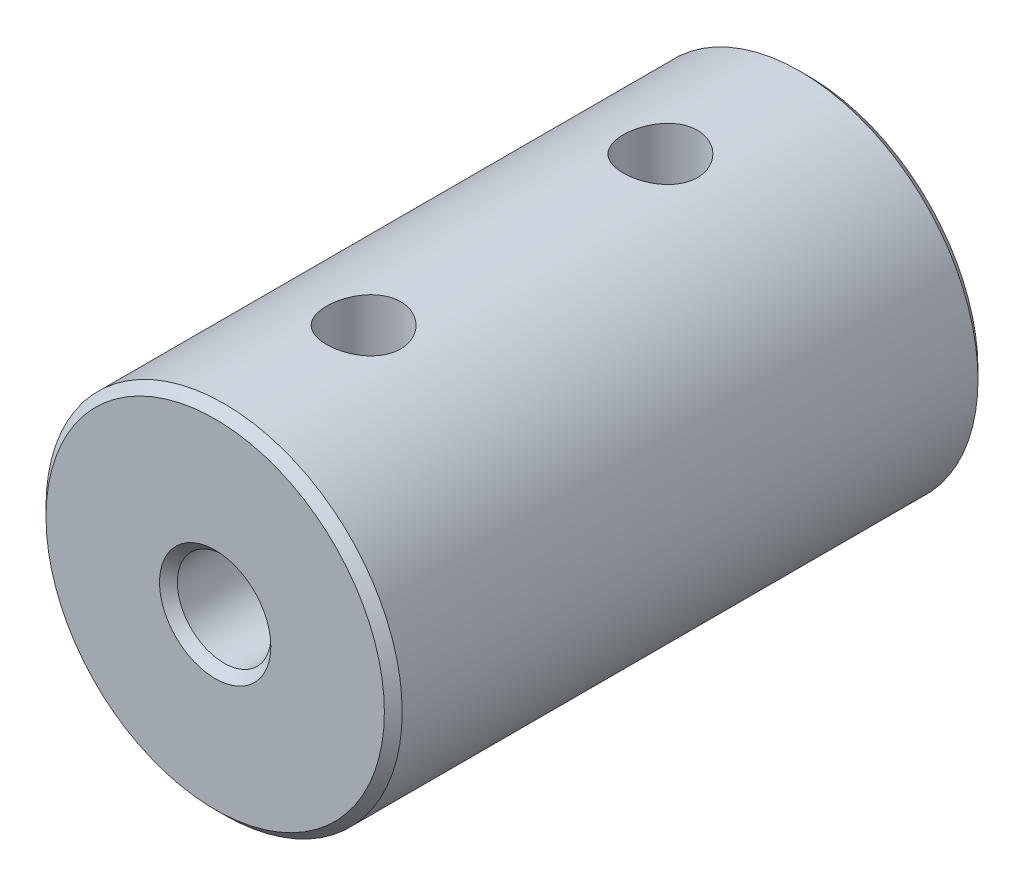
ISO-10303-21;
HEADER;
FILE_DESCRIPTION(('STEP AP214'),'2;1');
FILE_NAME('part.step','',(''),(''),'','','');
FILE_SCHEMA(('AUTOMOTIVE_DESIGN { 1 0 10303 214 1 1 1 1 }'));
ENDSEC;
DATA;
#1=APPLICATION_CONTEXT('core data for automotive mechanical design processes');
#2=APPLICATION_PROTOCOL_DEFINITION('international standard','automotive_design',2000,#1);
#3=PRODUCT_CONTEXT('',#1,'mechanical');
#4=PRODUCT('Part','Part','',(#3));
#5=PRODUCT_RELATED_PRODUCT_CATEGORY('part','',(#4));
#6=PRODUCT_DEFINITION_FORMATION('','',#4);
#7=PRODUCT_DEFINITION_CONTEXT('part definition',#1,'design');
#8=PRODUCT_DEFINITION('design','',#6,#7);
#9=PRODUCT_DEFINITION_SHAPE('','',#8);
#10=(LENGTH_UNIT() NAMED_UNIT(*) SI_UNIT(.MILLI.,.METRE.));
#11=(NAMED_UNIT(*) PLANE_ANGLE_UNIT() SI_UNIT($,.RADIAN.));
#12=(NAMED_UNIT(*) SI_UNIT($,.STERADIAN.) SOLID_ANGLE_UNIT());
#13=UNCERTAINTY_MEASURE_WITH_UNIT(LENGTH_MEASURE(1.E-05),#10,'distance_accuracy_value','');
#14=(GEOMETRIC_REPRESENTATION_CONTEXT(3) GLOBAL_UNCERTAINTY_ASSIGNED_CONTEXT((#13)) GLOBAL_UNIT_ASSIGNED_CONTEXT((#10,
#11,#12)) REPRESENTATION_CONTEXT('',''));
#15=CARTESIAN_POINT('',(0.,0.,0.));
#16=DIRECTION('',(0.,0.,1.));
#17=DIRECTION('',(1.,0.,0.));
#18=AXIS2_PLACEMENT_3D('',#15,#16,#17);
#19=CARTESIAN_POINT('',(0.,0.,10.));
#20=DIRECTION('',(0.,0.,-1.));
#21=DIRECTION('',(-1.,0.,0.));
#22=AXIS2_PLACEMENT_3D('',#19,#20,#21);
#23=CYLINDRICAL_SURFACE('',#22,1.075);
#24=CARTESIAN_POINT('',(-1.075,0.,-4.36213245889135));
#25=CARTESIAN_POINT('',(-1.07499657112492,-0.0358670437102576,-4.36212262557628));
#26=CARTESIAN_POINT('',(-1.07318157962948,-0.071776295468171,-4.35903784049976));
#27=CARTESIAN_POINT('',(-1.06612758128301,-0.142364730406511,-4.34737942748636));
#28=CARTESIAN_POINT('',(-1.06087817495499,-0.177039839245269,-4.33878913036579));
#29=CARTESIAN_POINT('',(-1.04454213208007,-0.258757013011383,-4.31316441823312));
#30=CARTESIAN_POINT('',(-1.03192610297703,-0.304831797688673,-4.29409560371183));
#31=CARTESIAN_POINT('',(-1.00160355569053,-0.393206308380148,-4.25168392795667));
#32=CARTESIAN_POINT('',(-0.983878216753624,-0.435491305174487,-4.2283253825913));
#33=CARTESIAN_POINT('',(-0.93312613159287,-0.538253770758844,-4.16687964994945));
#34=CARTESIAN_POINT('',(-0.896973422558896,-0.596459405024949,-4.12756126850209));
#35=CARTESIAN_POINT('',(-0.814122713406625,-0.705327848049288,-4.04976213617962));
#36=CARTESIAN_POINT('',(-0.767435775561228,-0.755998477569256,-4.01128055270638));
#37=CARTESIAN_POINT('',(-0.675019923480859,-0.838388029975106,-3.94677863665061));
#38=CARTESIAN_POINT('',(-0.631418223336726,-0.871809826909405,-3.91989765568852));
#39=CARTESIAN_POINT('',(-0.537903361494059,-0.932403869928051,-3.87042203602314));
#40=CARTESIAN_POINT('',(-0.488000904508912,-0.959586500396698,-3.84782028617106));
#41=CARTESIAN_POINT('',(-0.392134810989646,-1.00203817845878,-3.81220846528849));
#42=CARTESIAN_POINT('',(-0.347107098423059,-1.0185750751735,-3.7982013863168));
#43=CARTESIAN_POINT('',(-0.254060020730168,-1.04566766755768,-3.7751552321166));
#44=CARTESIAN_POINT('',(-0.206042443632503,-1.05622690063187,-3.76611321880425));
#45=CARTESIAN_POINT('',(-0.108037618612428,-1.07070839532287,-3.75369450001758));
#46=CARTESIAN_POINT('',(-0.0580419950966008,-1.0745984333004,-3.75034530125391));
#47=CARTESIAN_POINT('',(0.0420396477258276,-1.07534201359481,-3.74970591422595));
#48=CARTESIAN_POINT('',(0.0921256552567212,-1.07219641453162,-3.75241498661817));
#49=CARTESIAN_POINT('',(0.186835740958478,-1.05963261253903,-3.76319477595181));
#50=CARTESIAN_POINT('',(0.231580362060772,-1.05072499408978,-3.77082893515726));
#51=CARTESIAN_POINT('',(0.318672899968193,-1.02766894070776,-3.79047851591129));
#52=CARTESIAN_POINT('',(0.361020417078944,-1.01351963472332,-3.80249466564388));
#53=CARTESIAN_POINT('',(0.445663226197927,-0.979411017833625,-3.83122722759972));
#54=CARTESIAN_POINT('',(0.487716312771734,-0.959095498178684,-3.8482286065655));
#55=CARTESIAN_POINT('',(0.567762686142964,-0.91399395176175,-3.88550484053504));
#56=CARTESIAN_POINT('',(0.605753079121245,-0.889204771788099,-3.90578200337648));
#57=CARTESIAN_POINT('',(0.695638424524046,-0.822342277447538,-3.95954604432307));
#58=CARTESIAN_POINT('',(0.744857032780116,-0.777865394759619,-3.99452977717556));
#59=CARTESIAN_POINT('',(0.833752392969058,-0.681755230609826,-4.06691605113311));
#60=CARTESIAN_POINT('',(0.873405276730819,-0.630104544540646,-4.10432435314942));
#61=CARTESIAN_POINT('',(0.936182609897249,-0.530954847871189,-4.17071398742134));
#62=CARTESIAN_POINT('',(0.961025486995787,-0.484665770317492,-4.19989453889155));
#63=CARTESIAN_POINT('',(1.00421752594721,-0.387297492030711,-4.25484820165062));
#64=CARTESIAN_POINT('',(1.02258702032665,-0.336233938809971,-4.28063181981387));
#65=CARTESIAN_POINT('',(1.04584248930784,-0.25081875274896,-4.31519397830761));
#66=CARTESIAN_POINT('',(1.05316734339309,-0.2182219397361,-4.32660659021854));
#67=CARTESIAN_POINT('',(1.06483003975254,-0.151354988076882,-4.34520400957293));
#68=CARTESIAN_POINT('',(1.06917556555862,-0.117089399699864,-4.35239968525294));
#69=CARTESIAN_POINT('',(1.07454048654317,-0.0471711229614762,-4.36133378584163));
#70=CARTESIAN_POINT('',(1.07552370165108,-0.0115074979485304,-4.36301284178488));
#71=CARTESIAN_POINT('',(1.07394011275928,0.0595211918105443,-4.36034887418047));
#72=CARTESIAN_POINT('',(1.07137056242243,0.0948860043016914,-4.35600119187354));
#73=CARTESIAN_POINT('',(1.06224484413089,0.170109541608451,-4.34104610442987));
#74=CARTESIAN_POINT('',(1.05507918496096,0.209695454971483,-4.32949093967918));
#75=CARTESIAN_POINT('',(1.03692327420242,0.286314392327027,-4.30174110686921));
#76=CARTESIAN_POINT('',(1.02591920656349,0.32333760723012,-4.28552971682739));
#77=CARTESIAN_POINT('',(0.991879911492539,0.419410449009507,-4.23843051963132));
#78=CARTESIAN_POINT('',(0.965769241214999,0.476152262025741,-4.20510237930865));
#79=CARTESIAN_POINT('',(0.904966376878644,0.583493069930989,-4.13648019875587));
#80=CARTESIAN_POINT('',(0.870258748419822,0.634080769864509,-4.10118271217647));
#81=CARTESIAN_POINT('',(0.790164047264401,0.731754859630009,-4.02985916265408));
#82=CARTESIAN_POINT('',(0.744299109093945,0.778501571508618,-3.99389775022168));
#83=CARTESIAN_POINT('',(0.643005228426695,0.864022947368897,-3.92634583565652));
#84=CARTESIAN_POINT('',(0.58760328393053,0.902819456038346,-3.8947434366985));
#85=CARTESIAN_POINT('',(0.485526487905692,0.960326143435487,-3.84720942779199));
#86=CARTESIAN_POINT('',(0.441154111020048,0.981578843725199,-3.8294121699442));
#87=CARTESIAN_POINT('',(0.348466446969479,1.01817098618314,-3.79856350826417));
#88=CARTESIAN_POINT('',(0.300153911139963,1.03351451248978,-3.78550882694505));
#89=CARTESIAN_POINT('',(0.20030578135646,1.05742790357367,-3.76509529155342));
#90=CARTESIAN_POINT('',(0.148749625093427,1.06594858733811,-3.75777780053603));
#91=CARTESIAN_POINT('',(0.0444400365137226,1.07535423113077,-3.74969782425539));
#92=CARTESIAN_POINT('',(-0.00831273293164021,1.0762433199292,-3.74893179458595));
#93=CARTESIAN_POINT('',(-0.107225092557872,1.07065756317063,-3.75373298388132));
#94=CARTESIAN_POINT('',(-0.15346810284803,1.06498699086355,-3.75860851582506));
#95=CARTESIAN_POINT('',(-0.244086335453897,1.04793763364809,-3.77320379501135));
#96=CARTESIAN_POINT('',(-0.288461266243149,1.03655796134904,-3.78292429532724));
#97=CARTESIAN_POINT('',(-0.375442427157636,1.00837070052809,-3.8068406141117));
#98=CARTESIAN_POINT('',(-0.417977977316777,0.99143608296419,-3.82114096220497));
#99=CARTESIAN_POINT('',(-0.499462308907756,0.952992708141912,-3.85328312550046));
#100=CARTESIAN_POINT('',(-0.538409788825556,0.931482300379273,-3.87112621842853));
#101=CARTESIAN_POINT('',(-0.630044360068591,0.873413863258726,-3.918646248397));
#102=CARTESIAN_POINT('',(-0.680458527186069,0.834564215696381,-3.94991583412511));
#103=CARTESIAN_POINT('',(-0.772737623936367,0.749961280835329,-4.01582238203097));
#104=CARTESIAN_POINT('',(-0.814573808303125,0.70418564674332,-4.05047011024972));
#105=CARTESIAN_POINT('',(-0.89041837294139,0.605586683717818,-4.12114192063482));
#106=CARTESIAN_POINT('',(-0.924251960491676,0.552639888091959,-4.15717966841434));
#107=CARTESIAN_POINT('',(-0.982794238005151,0.440171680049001,-4.22628854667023));
#108=CARTESIAN_POINT('',(-1.00753165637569,0.380671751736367,-4.25936876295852));
#109=CARTESIAN_POINT('',(-1.03734125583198,0.284160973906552,-4.30231962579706));
#110=CARTESIAN_POINT('',(-1.04617005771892,0.249918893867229,-4.31574470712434));
#111=CARTESIAN_POINT('',(-1.0605276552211,0.179411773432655,-4.3382149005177));
#112=CARTESIAN_POINT('',(-1.06606979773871,0.143155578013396,-4.34727769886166));
#113=CARTESIAN_POINT('',(-1.07147571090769,0.0887430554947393,-4.35622158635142));
#114=CARTESIAN_POINT('',(-1.07279292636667,0.0710975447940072,-4.35842479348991));
#115=CARTESIAN_POINT('',(-1.07455601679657,0.0356381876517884,-4.36138282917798));
#116=CARTESIAN_POINT('',(-1.07500170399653,0.0178243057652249,-4.36213734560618));
#117=CARTESIAN_POINT('',(-1.075,0.,-4.36213245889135));
#118=B_SPLINE_CURVE_WITH_KNOTS('',3,(#24,#25,#26,#27,#28,#29,#30,#31,#32,#33,#34,#35,#36,#37,
#38,#39,#40,#41,#42,#43,#44,#45,#46,#47,#48,#49,#50,#51,#52,#53,#54,#55,#56,#57,#58,#59,#60,#61,
#62,#63,#64,#65,#66,#67,#68,#69,#70,#71,#72,#73,#74,#75,#76,#77,#78,#79,#80,#81,#82,#83,#84,#85,
#86,#87,#88,#89,#90,#91,#92,#93,#94,#95,#96,#97,#98,#99,#100,#101,#102,#103,#104,#105,#106,#107,
#108,#109,#110,#111,#112,#113,#114,#115,#116,#117),.UNSPECIFIED.,.T.,.F.,(4,2,2,2,2,2,2,2,2,2,2,
2,2,2,2,2,2,2,2,2,2,2,2,2,2,2,2,2,2,2,2,2,2,2,2,2,2,2,2,2,2,2,2,2,2,2,4),(0.,0.107520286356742,
0.21536766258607,0.368797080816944,0.522799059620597,0.758629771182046,0.994213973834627,
1.17703619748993,1.35955189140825,1.50885203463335,1.65806373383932,1.80799437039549,
1.95790671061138,2.09607749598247,2.23427125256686,2.38283134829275,2.53149656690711,
2.75529630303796,2.97964881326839,3.15948261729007,3.33874643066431,3.44434905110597,
3.54967829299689,3.65613742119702,3.76267888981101,3.8875389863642,4.01285322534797,
4.22411105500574,4.43575094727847,4.65889228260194,4.88141202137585,5.03777469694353,
5.19402910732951,5.35139995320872,5.50868565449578,5.64856024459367,5.78845658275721,
5.93180554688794,6.07520630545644,6.28679458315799,6.4990807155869,6.71564611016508,
6.93152152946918,7.04468883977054,7.15739338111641,7.21081461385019,7.26424735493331),.UNSPECIFIED.);
#119=CARTESIAN_POINT('',(-1.075,0.,-4.36213245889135));
#120=VERTEX_POINT('',#119);
#121=EDGE_CURVE('E96',#120,#120,#118,.T.);
#122=ORIENTED_EDGE('',*,*,#121,.F.);
#123=EDGE_LOOP('',(#122));
#124=FACE_BOUND('',#123,.T.);
#125=CARTESIAN_POINT('',(0.,0.,0.));
#126=DIRECTION('',(0.,0.,1.));
#127=DIRECTION('',(1.,0.,0.));
#128=AXIS2_PLACEMENT_3D('',#125,#126,#127);
#129=CIRCLE('',#128,1.075);
#130=CARTESIAN_POINT('',(1.075,0.,0.));
#131=VERTEX_POINT('',#130);
#132=EDGE_CURVE('E128',#131,#131,#129,.T.);
#133=ORIENTED_EDGE('',*,*,#132,.T.);
#134=EDGE_LOOP('',(#133));
#135=FACE_BOUND('',#134,.T.);
#136=ADVANCED_FACE('F30',(#124,#135),#23,.F.);
#137=CARTESIAN_POINT('',(0.,0.,-9.7));
#138=DIRECTION('',(0.,0.,1.));
#139=DIRECTION('',(1.,0.,0.));
#140=AXIS2_PLACEMENT_3D('',#137,#138,#139);
#141=CIRCLE('',#140,1.075);
#142=CARTESIAN_POINT('',(1.075,0.,-9.7));
#143=VERTEX_POINT('',#142);
#144=EDGE_CURVE('E45',#143,#143,#141,.F.);
#145=ORIENTED_EDGE('',*,*,#144,.T.);
#146=EDGE_LOOP('',(#145));
#147=FACE_BOUND('',#146,.T.);
#148=CARTESIAN_POINT('',(-1.075,0.,-5.63786754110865));
#149=CARTESIAN_POINT('',(-1.07499657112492,0.0358670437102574,-5.63787737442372));
#150=CARTESIAN_POINT('',(-1.07318157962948,0.0717762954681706,-5.64096215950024));
#151=CARTESIAN_POINT('',(-1.06612758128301,0.142364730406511,-5.65262057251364));
#152=CARTESIAN_POINT('',(-1.06087817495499,0.177039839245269,-5.66121086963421));
#153=CARTESIAN_POINT('',(-1.04454213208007,0.258757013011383,-5.68683558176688));
#154=CARTESIAN_POINT('',(-1.03192610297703,0.304831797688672,-5.70590439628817));
#155=CARTESIAN_POINT('',(-1.00160355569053,0.393206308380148,-5.74831607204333));
#156=CARTESIAN_POINT('',(-0.983878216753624,0.435491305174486,-5.7716746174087));
#157=CARTESIAN_POINT('',(-0.93312613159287,0.538253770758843,-5.83312035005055));
#158=CARTESIAN_POINT('',(-0.896973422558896,0.596459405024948,-5.87243873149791));
#159=CARTESIAN_POINT('',(-0.814122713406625,0.705327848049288,-5.95023786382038));
#160=CARTESIAN_POINT('',(-0.767435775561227,0.755998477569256,-5.98871944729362));
#161=CARTESIAN_POINT('',(-0.675019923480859,0.838388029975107,-6.05322136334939));
#162=CARTESIAN_POINT('',(-0.631418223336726,0.871809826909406,-6.08010234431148));
#163=CARTESIAN_POINT('',(-0.537903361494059,0.932403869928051,-6.12957796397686));
#164=CARTESIAN_POINT('',(-0.488000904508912,0.959586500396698,-6.15217971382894));
#165=CARTESIAN_POINT('',(-0.392134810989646,1.00203817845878,-6.18779153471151));
#166=CARTESIAN_POINT('',(-0.347107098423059,1.0185750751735,-6.2017986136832));
#167=CARTESIAN_POINT('',(-0.254060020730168,1.04566766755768,-6.2248447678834));
#168=CARTESIAN_POINT('',(-0.206042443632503,1.05622690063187,-6.23388678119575));
#169=CARTESIAN_POINT('',(-0.108037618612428,1.07070839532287,-6.24630549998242));
#170=CARTESIAN_POINT('',(-0.0580419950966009,1.0745984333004,-6.24965469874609));
#171=CARTESIAN_POINT('',(0.0420396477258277,1.07534201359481,-6.25029408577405));
#172=CARTESIAN_POINT('',(0.0921256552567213,1.07219641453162,-6.24758501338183));
#173=CARTESIAN_POINT('',(0.186835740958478,1.05963261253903,-6.23680522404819));
#174=CARTESIAN_POINT('',(0.231580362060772,1.05072499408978,-6.22917106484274));
#175=CARTESIAN_POINT('',(0.318672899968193,1.02766894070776,-6.20952148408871));
#176=CARTESIAN_POINT('',(0.361020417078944,1.01351963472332,-6.19750533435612));
#177=CARTESIAN_POINT('',(0.445663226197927,0.979411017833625,-6.16877277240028));
#178=CARTESIAN_POINT('',(0.487716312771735,0.959095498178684,-6.1517713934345));
#179=CARTESIAN_POINT('',(0.567762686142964,0.91399395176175,-6.11449515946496));
#180=CARTESIAN_POINT('',(0.605753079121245,0.889204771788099,-6.09421799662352));
#181=CARTESIAN_POINT('',(0.695638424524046,0.822342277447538,-6.04045395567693));
#182=CARTESIAN_POINT('',(0.744857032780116,0.777865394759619,-6.00547022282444));
#183=CARTESIAN_POINT('',(0.833752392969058,0.681755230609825,-5.93308394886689));
#184=CARTESIAN_POINT('',(0.873405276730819,0.630104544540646,-5.89567564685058));
#185=CARTESIAN_POINT('',(0.936182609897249,0.530954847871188,-5.82928601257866));
#186=CARTESIAN_POINT('',(0.961025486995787,0.484665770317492,-5.80010546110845));
#187=CARTESIAN_POINT('',(1.00421752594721,0.387297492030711,-5.74515179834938));
#188=CARTESIAN_POINT('',(1.02258702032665,0.336233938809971,-5.71936818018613));
#189=CARTESIAN_POINT('',(1.04584248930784,0.250818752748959,-5.68480602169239));
#190=CARTESIAN_POINT('',(1.05316734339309,0.218221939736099,-5.67339340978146));
#191=CARTESIAN_POINT('',(1.06483003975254,0.151354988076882,-5.65479599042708));
#192=CARTESIAN_POINT('',(1.06917556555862,0.117089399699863,-5.64760031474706));
#193=CARTESIAN_POINT('',(1.07454048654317,0.0471711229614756,-5.63866621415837));
#194=CARTESIAN_POINT('',(1.07552370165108,0.01150749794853,-5.63698715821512));
#195=CARTESIAN_POINT('',(1.07394011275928,-0.0595211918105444,-5.63965112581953));
#196=CARTESIAN_POINT('',(1.07137056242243,-0.0948860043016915,-5.64399880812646));
#197=CARTESIAN_POINT('',(1.06224484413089,-0.170109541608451,-5.65895389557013));
#198=CARTESIAN_POINT('',(1.05507918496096,-0.209695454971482,-5.67050906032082));
#199=CARTESIAN_POINT('',(1.03692327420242,-0.286314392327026,-5.69825889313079));
#200=CARTESIAN_POINT('',(1.02591920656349,-0.32333760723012,-5.71447028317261));
#201=CARTESIAN_POINT('',(0.991879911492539,-0.419410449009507,-5.76156948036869));
#202=CARTESIAN_POINT('',(0.965769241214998,-0.476152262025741,-5.79489762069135));
#203=CARTESIAN_POINT('',(0.904966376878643,-0.58349306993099,-5.86351980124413));
#204=CARTESIAN_POINT('',(0.870258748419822,-0.634080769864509,-5.89881728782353));
#205=CARTESIAN_POINT('',(0.790164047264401,-0.731754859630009,-5.97014083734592));
#206=CARTESIAN_POINT('',(0.744299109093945,-0.778501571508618,-6.00610224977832));
#207=CARTESIAN_POINT('',(0.643005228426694,-0.864022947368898,-6.07365416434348));
#208=CARTESIAN_POINT('',(0.58760328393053,-0.902819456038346,-6.1052565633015));
#209=CARTESIAN_POINT('',(0.485526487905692,-0.960326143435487,-6.15279057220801));
#210=CARTESIAN_POINT('',(0.441154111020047,-0.981578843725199,-6.1705878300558));
#211=CARTESIAN_POINT('',(0.348466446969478,-1.01817098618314,-6.20143649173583));
#212=CARTESIAN_POINT('',(0.300153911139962,-1.03351451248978,-6.21449117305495));
#213=CARTESIAN_POINT('',(0.20030578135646,-1.05742790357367,-6.23490470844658));
#214=CARTESIAN_POINT('',(0.148749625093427,-1.06594858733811,-6.24222219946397));
#215=CARTESIAN_POINT('',(0.0444400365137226,-1.07535423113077,-6.25030217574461));
#216=CARTESIAN_POINT('',(-0.00831273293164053,-1.0762433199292,-6.25106820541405));
#217=CARTESIAN_POINT('',(-0.107225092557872,-1.07065756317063,-6.24626701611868));
#218=CARTESIAN_POINT('',(-0.15346810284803,-1.06498699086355,-6.24139148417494));
#219=CARTESIAN_POINT('',(-0.244086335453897,-1.04793763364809,-6.22679620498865));
#220=CARTESIAN_POINT('',(-0.28846126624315,-1.03655796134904,-6.21707570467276));
#221=CARTESIAN_POINT('',(-0.375442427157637,-1.00837070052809,-6.1931593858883));
#222=CARTESIAN_POINT('',(-0.417977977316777,-0.99143608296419,-6.17885903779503));
#223=CARTESIAN_POINT('',(-0.499462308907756,-0.952992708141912,-6.14671687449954));
#224=CARTESIAN_POINT('',(-0.538409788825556,-0.931482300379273,-6.12887378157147));
#225=CARTESIAN_POINT('',(-0.630044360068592,-0.873413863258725,-6.08135375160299));
#226=CARTESIAN_POINT('',(-0.68045852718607,-0.83456421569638,-6.05008416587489));
#227=CARTESIAN_POINT('',(-0.772737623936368,-0.749961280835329,-5.98417761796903));
#228=CARTESIAN_POINT('',(-0.814573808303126,-0.70418564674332,-5.94952988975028));
#229=CARTESIAN_POINT('',(-0.89041837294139,-0.605586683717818,-5.87885807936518));
#230=CARTESIAN_POINT('',(-0.924251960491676,-0.552639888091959,-5.84282033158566));
#231=CARTESIAN_POINT('',(-0.982794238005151,-0.440171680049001,-5.77371145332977));
#232=CARTESIAN_POINT('',(-1.00753165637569,-0.380671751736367,-5.74063123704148));
#233=CARTESIAN_POINT('',(-1.03734125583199,-0.284160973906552,-5.69768037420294));
#234=CARTESIAN_POINT('',(-1.04617005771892,-0.249918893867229,-5.68425529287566));
#235=CARTESIAN_POINT('',(-1.0605276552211,-0.179411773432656,-5.6617850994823));
#236=CARTESIAN_POINT('',(-1.06606979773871,-0.143155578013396,-5.65272230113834));
#237=CARTESIAN_POINT('',(-1.07147571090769,-0.0887430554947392,-5.64377841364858));
#238=CARTESIAN_POINT('',(-1.07279292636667,-0.0710975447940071,-5.64157520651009));
#239=CARTESIAN_POINT('',(-1.07455601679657,-0.0356381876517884,-5.63861717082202));
#240=CARTESIAN_POINT('',(-1.07500170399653,-0.0178243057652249,-5.63786265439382));
#241=CARTESIAN_POINT('',(-1.075,0.,-5.63786754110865));
#242=B_SPLINE_CURVE_WITH_KNOTS('',3,(#148,#149,#150,#151,#152,#153,#154,#155,#156,#157,#158,
#159,#160,#161,#162,#163,#164,#165,#166,#167,#168,#169,#170,#171,#172,#173,#174,#175,#176,#177,
#178,#179,#180,#181,#182,#183,#184,#185,#186,#187,#188,#189,#190,#191,#192,#193,#194,#195,#196,
#197,#198,#199,#200,#201,#202,#203,#204,#205,#206,#207,#208,#209,#210,#211,#212,#213,#214,#215,
#216,#217,#218,#219,#220,#221,#222,#223,#224,#225,#226,#227,#228,#229,#230,#231,#232,#233,#234,
#235,#236,#237,#238,#239,#240,#241),.UNSPECIFIED.,.T.,.F.,(4,2,2,2,2,2,2,2,2,2,2,2,2,2,2,2,2,2,
2,2,2,2,2,2,2,2,2,2,2,2,2,2,2,2,2,2,2,2,2,2,2,2,2,2,2,2,4),(0.,0.107520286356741,
0.21536766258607,0.368797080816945,0.522799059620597,0.758629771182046,0.994213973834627,
1.17703619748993,1.35955189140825,1.50885203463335,1.65806373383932,1.80799437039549,
1.95790671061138,2.09607749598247,2.23427125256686,2.38283134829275,2.53149656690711,
2.75529630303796,2.97964881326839,3.15948261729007,3.33874643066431,3.44434905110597,
3.54967829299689,3.65613742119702,3.76267888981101,3.8875389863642,4.01285322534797,
4.22411105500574,4.43575094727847,4.65889228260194,4.88141202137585,5.03777469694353,
5.19402910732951,5.35139995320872,5.50868565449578,5.64856024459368,5.78845658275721,
5.93180554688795,6.07520630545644,6.28679458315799,6.4990807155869,6.71564611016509,
6.93152152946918,7.04468883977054,7.15739338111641,7.21081461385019,7.26424735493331),.UNSPECIFIED.);
#243=CARTESIAN_POINT('',(-1.075,0.,-5.63786754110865));
#244=VERTEX_POINT('',#243);
#245=EDGE_CURVE('E91',#244,#244,#242,.T.);
#246=ORIENTED_EDGE('',*,*,#245,.F.);
#247=EDGE_LOOP('',(#246));
#248=FACE_BOUND('',#247,.T.);
#249=ADVANCED_FACE('F100',(#147,#248),#23,.F.);
#250=CARTESIAN_POINT('',(0.,0.,10.));
#251=DIRECTION('',(0.,0.,1.));
#252=DIRECTION('',(1.,0.,0.));
#253=AXIS2_PLACEMENT_3D('',#250,#251,#252);
#254=PLANE('',#253);
#255=CARTESIAN_POINT('',(0.,0.,10.));
#256=DIRECTION('',(0.,0.,1.));
#257=DIRECTION('',(1.,0.,0.));
#258=AXIS2_PLACEMENT_3D('',#255,#256,#257);
#259=CIRCLE('',#258,1.87500000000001);
#260=CARTESIAN_POINT('',(1.87500000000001,0.,10.));
#261=VERTEX_POINT('',#260);
#262=EDGE_CURVE('E10',#261,#261,#259,.F.);
#263=ORIENTED_EDGE('',*,*,#262,.T.);
#264=EDGE_LOOP('',(#263));
#265=FACE_BOUND('',#264,.T.);
#266=CARTESIAN_POINT('',(0.,0.,10.));
#267=DIRECTION('',(0.,0.,1.));
#268=DIRECTION('',(1.,0.,0.));
#269=AXIS2_PLACEMENT_3D('',#266,#267,#268);
#270=CIRCLE('',#269,5.7);
#271=CARTESIAN_POINT('',(-5.7,0.,10.));
#272=VERTEX_POINT('',#271);
#273=EDGE_CURVE('E37',#272,#272,#270,.T.);
#274=ORIENTED_EDGE('',*,*,#273,.T.);
#275=EDGE_LOOP('',(#274));
#276=FACE_BOUND('',#275,.T.);
#277=ADVANCED_FACE('F105',(#265,#276),#254,.T.);
#278=CARTESIAN_POINT('',(0.,0.,-10.));
#279=DIRECTION('',(0.,0.,1.));
#280=DIRECTION('',(1.,0.,0.));
#281=AXIS2_PLACEMENT_3D('',#278,#279,#280);
#282=PLANE('',#281);
#283=CARTESIAN_POINT('',(0.,0.,-10.));
#284=DIRECTION('',(0.,0.,1.));
#285=DIRECTION('',(1.,0.,0.));
#286=AXIS2_PLACEMENT_3D('',#283,#284,#285);
#287=CIRCLE('',#286,5.7);
#288=CARTESIAN_POINT('',(5.7,0.,-10.));
#289=VERTEX_POINT('',#288);
#290=EDGE_CURVE('E50',#289,#289,#287,.F.);
#291=ORIENTED_EDGE('',*,*,#290,.T.);
#292=EDGE_LOOP('',(#291));
#293=FACE_BOUND('',#292,.T.);
#294=CARTESIAN_POINT('',(0.,0.,-10.));
#295=DIRECTION('',(0.,0.,1.));
#296=DIRECTION('',(1.,0.,0.));
#297=AXIS2_PLACEMENT_3D('',#294,#295,#296);
#298=CIRCLE('',#297,1.375);
#299=CARTESIAN_POINT('',(1.375,0.,-10.));
#300=VERTEX_POINT('',#299);
#301=EDGE_CURVE('E53',#300,#300,#298,.T.);
#302=ORIENTED_EDGE('',*,*,#301,.T.);
#303=EDGE_LOOP('',(#302));
#304=FACE_BOUND('',#303,.T.);
#305=ADVANCED_FACE('F111',(#293,#304),#282,.F.);
#306=CARTESIAN_POINT('',(0.,0.,10.));
#307=DIRECTION('',(0.,0.,-1.));
#308=DIRECTION('',(-1.,0.,0.));
#309=AXIS2_PLACEMENT_3D('',#306,#307,#308);
#310=CYLINDRICAL_SURFACE('',#309,6.);
#311=CARTESIAN_POINT('',(0.,0.,-9.7));
#312=DIRECTION('',(0.,0.,1.));
#313=DIRECTION('',(1.,0.,0.));
#314=AXIS2_PLACEMENT_3D('',#311,#312,#313);
#315=CIRCLE('',#314,6.);
#316=CARTESIAN_POINT('',(6.,0.,-9.7));
#317=VERTEX_POINT('',#316);
#318=EDGE_CURVE('E56',#317,#317,#315,.T.);
#319=ORIENTED_EDGE('',*,*,#318,.T.);
#320=EDGE_LOOP('',(#319));
#321=FACE_BOUND('',#320,.T.);
#322=CARTESIAN_POINT('',(0.,0.,9.7));
#323=DIRECTION('',(0.,0.,1.));
#324=DIRECTION('',(1.,0.,0.));
#325=AXIS2_PLACEMENT_3D('',#322,#323,#324);
#326=CIRCLE('',#325,6.);
#327=CARTESIAN_POINT('',(-6.,0.,9.7));
#328=VERTEX_POINT('',#327);
#329=EDGE_CURVE('E59',#328,#328,#326,.F.);
#330=ORIENTED_EDGE('',*,*,#329,.T.);
#331=EDGE_LOOP('',(#330));
#332=FACE_BOUND('',#331,.T.);
#333=CARTESIAN_POINT('',(0.,-6.,-3.75));
#334=CARTESIAN_POINT('',(0.0694090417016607,-5.99999871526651,-3.75000247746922));
#335=CARTESIAN_POINT('',(0.138848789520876,-5.99878328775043,-3.75580066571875));
#336=CARTESIAN_POINT('',(0.275761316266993,-5.9940520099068,-3.77881934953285));
#337=CARTESIAN_POINT('',(0.343232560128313,-5.99053441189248,-3.79604852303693));
#338=CARTESIAN_POINT('',(0.474209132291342,-5.98159109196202,-3.84137045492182));
#339=CARTESIAN_POINT('',(0.537718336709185,-5.97616727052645,-3.86945239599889));
#340=CARTESIAN_POINT('',(0.659120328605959,-5.96399927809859,-3.93564960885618));
#341=CARTESIAN_POINT('',(0.717013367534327,-5.95725516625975,-3.97376443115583));
#342=CARTESIAN_POINT('',(0.826390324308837,-5.9430770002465,-4.05953634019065));
#343=CARTESIAN_POINT('',(0.877780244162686,-5.93563505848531,-4.10731200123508));
#344=CARTESIAN_POINT('',(0.971877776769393,-5.92095657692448,-4.21079465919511));
#345=CARTESIAN_POINT('',(1.01458467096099,-5.91372005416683,-4.26650231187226));
#346=CARTESIAN_POINT('',(1.09051031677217,-5.90019442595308,-4.38495196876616));
#347=CARTESIAN_POINT('',(1.12363054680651,-5.89391545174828,-4.44775838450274));
#348=CARTESIAN_POINT('',(1.17881119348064,-5.8831284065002,-4.57819745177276));
#349=CARTESIAN_POINT('',(1.20087280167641,-5.87862014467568,-4.64582958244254));
#350=CARTESIAN_POINT('',(1.23300240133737,-5.87196500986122,-4.78298523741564));
#351=CARTESIAN_POINT('',(1.24323597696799,-5.86978556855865,-4.85246835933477));
#352=CARTESIAN_POINT('',(1.25193357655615,-5.86793690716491,-4.99219684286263));
#353=CARTESIAN_POINT('',(1.25039890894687,-5.86826740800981,-5.0624421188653));
#354=CARTESIAN_POINT('',(1.23573719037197,-5.87137174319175,-5.20048102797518));
#355=CARTESIAN_POINT('',(1.2228010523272,-5.87410533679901,-5.26829597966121));
#356=CARTESIAN_POINT('',(1.18600543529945,-5.88164437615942,-5.40077150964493));
#357=CARTESIAN_POINT('',(1.16214539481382,-5.88644992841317,-5.46543192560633));
#358=CARTESIAN_POINT('',(1.10400003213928,-5.89763191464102,-5.59030722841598));
#359=CARTESIAN_POINT('',(1.06964002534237,-5.90401953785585,-5.65048629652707));
#360=CARTESIAN_POINT('',(0.991522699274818,-5.91763890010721,-5.76429574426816));
#361=CARTESIAN_POINT('',(0.947764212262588,-5.92487074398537,-5.81792530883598));
#362=CARTESIAN_POINT('',(0.851074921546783,-5.93953730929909,-5.91821396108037));
#363=CARTESIAN_POINT('',(0.797981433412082,-5.94697323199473,-5.96471616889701));
#364=CARTESIAN_POINT('',(0.684667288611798,-5.96108088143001,-6.04818044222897));
#365=CARTESIAN_POINT('',(0.624446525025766,-5.96775259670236,-6.0851423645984));
#366=CARTESIAN_POINT('',(0.498405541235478,-5.97959870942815,-6.14851008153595));
#367=CARTESIAN_POINT('',(0.4325754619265,-5.98477039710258,-6.17489680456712));
#368=CARTESIAN_POINT('',(0.297284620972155,-5.99301338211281,-6.21619170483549));
#369=CARTESIAN_POINT('',(0.227824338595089,-5.99608495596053,-6.2311013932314));
#370=CARTESIAN_POINT('',(0.0885918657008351,-5.99974275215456,-6.24879425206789));
#371=CARTESIAN_POINT('',(0.0188480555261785,-6.00037293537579,-6.25179194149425));
#372=CARTESIAN_POINT('',(-0.120143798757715,-5.99919952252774,-6.2461550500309));
#373=CARTESIAN_POINT('',(-0.189391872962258,-5.99739607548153,-6.2375211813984));
#374=CARTESIAN_POINT('',(-0.324726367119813,-5.99158564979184,-6.20904434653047));
#375=CARTESIAN_POINT('',(-0.390837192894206,-5.98760052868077,-6.18931251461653));
#376=CARTESIAN_POINT('',(-0.518811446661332,-5.97787227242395,-6.13932213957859));
#377=CARTESIAN_POINT('',(-0.580674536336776,-5.97212899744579,-6.10906275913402));
#378=CARTESIAN_POINT('',(-0.699294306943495,-5.95941241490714,-6.03841962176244));
#379=CARTESIAN_POINT('',(-0.755973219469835,-5.9524239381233,-5.99790807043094));
#380=CARTESIAN_POINT('',(-0.861805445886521,-5.93802568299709,-5.90808043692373));
#381=CARTESIAN_POINT('',(-0.910957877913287,-5.93061585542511,-5.85876332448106));
#382=CARTESIAN_POINT('',(-1.0011786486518,-5.91606024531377,-5.7517444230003));
#383=CARTESIAN_POINT('',(-1.04209914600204,-5.90892089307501,-5.69391696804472));
#384=CARTESIAN_POINT('',(-1.11364719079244,-5.89585601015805,-5.57208371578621));
#385=CARTESIAN_POINT('',(-1.14427516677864,-5.88993042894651,-5.50807817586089));
#386=CARTESIAN_POINT('',(-1.19417246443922,-5.88001700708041,-5.37603880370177));
#387=CARTESIAN_POINT('',(-1.21350309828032,-5.87601872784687,-5.30802896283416));
#388=CARTESIAN_POINT('',(-1.24044038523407,-5.87039184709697,-5.16963344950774));
#389=CARTESIAN_POINT('',(-1.24804871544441,-5.86876290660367,-5.09924811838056));
#390=CARTESIAN_POINT('',(-1.25125926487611,-5.86807907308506,-4.95958659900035));
#391=CARTESIAN_POINT('',(-1.24709542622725,-5.86897402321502,-4.89031592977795));
#392=CARTESIAN_POINT('',(-1.22739905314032,-5.87312447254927,-4.75348599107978));
#393=CARTESIAN_POINT('',(-1.21186662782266,-5.87637994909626,-4.68592670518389));
#394=CARTESIAN_POINT('',(-1.16998217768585,-5.88486132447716,-4.55460222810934));
#395=CARTESIAN_POINT('',(-1.14366117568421,-5.8900815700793,-4.49082675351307));
#396=CARTESIAN_POINT('',(-1.08097457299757,-5.90190705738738,-4.36856122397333));
#397=CARTESIAN_POINT('',(-1.0446080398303,-5.9085124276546,-4.31007166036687));
#398=CARTESIAN_POINT('',(-0.962073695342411,-5.92251579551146,-4.19887837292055));
#399=CARTESIAN_POINT('',(-0.915737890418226,-5.92992613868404,-4.14630087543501));
#400=CARTESIAN_POINT('',(-0.814924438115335,-5.94461839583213,-4.04959050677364));
#401=CARTESIAN_POINT('',(-0.760444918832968,-5.9519002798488,-4.00545958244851));
#402=CARTESIAN_POINT('',(-0.644134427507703,-5.96561444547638,-3.92641142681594));
#403=CARTESIAN_POINT('',(-0.582225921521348,-5.97203596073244,-3.89160632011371));
#404=CARTESIAN_POINT('',(-0.453319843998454,-5.98319908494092,-3.83294977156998));
#405=CARTESIAN_POINT('',(-0.386326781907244,-5.98794216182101,-3.80908875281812));
#406=CARTESIAN_POINT('',(-0.266015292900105,-5.99432499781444,-3.77745972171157));
#407=CARTESIAN_POINT('',(-0.213367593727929,-5.99644035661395,-3.76718123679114));
#408=CARTESIAN_POINT('',(-0.107152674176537,-5.99927832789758,-3.75345054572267));
#409=CARTESIAN_POINT('',(-0.0535854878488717,-6.00000099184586,-3.74999808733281));
#410=CARTESIAN_POINT('',(0.,-6.,-3.75));
#411=B_SPLINE_CURVE_WITH_KNOTS('',3,(#333,#334,#335,#336,#337,#338,#339,#340,#341,#342,#343,
#344,#345,#346,#347,#348,#349,#350,#351,#352,#353,#354,#355,#356,#357,#358,#359,#360,#361,#362,
#363,#364,#365,#366,#367,#368,#369,#370,#371,#372,#373,#374,#375,#376,#377,#378,#379,#380,#381,
#382,#383,#384,#385,#386,#387,#388,#389,#390,#391,#392,#393,#394,#395,#396,#397,#398,#399,#400,
#401,#402,#403,#404,#405,#406,#407,#408,#409,#410),.UNSPECIFIED.,.T.,.F.,(4,2,2,2,2,2,2,2,2,2,2,
2,2,2,2,2,2,2,2,2,2,2,2,2,2,2,2,2,2,2,2,2,2,2,2,2,2,2,4),(0.,0.208031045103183,
0.416220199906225,0.624202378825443,0.83217524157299,1.04287526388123,1.25359271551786,
1.46640449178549,1.6791933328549,1.88896575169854,2.09871484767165,2.3050171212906,
2.5113300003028,2.71914592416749,2.92698768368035,3.13889526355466,3.35080602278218,
3.56309724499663,3.77536051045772,3.98378339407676,4.19219351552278,4.39855286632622,
4.60492863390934,4.81401583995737,5.02312752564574,5.23571263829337,5.4482888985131,
5.65970050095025,5.87108185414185,6.07829223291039,6.28550062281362,6.49211731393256,
6.6987531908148,6.9091902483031,7.1196757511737,7.33258864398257,7.54531486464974,
7.70592588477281,7.86653096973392),.UNSPECIFIED.);
#412=CARTESIAN_POINT('',(0.,-6.,-3.75));
#413=VERTEX_POINT('',#412);
#414=EDGE_CURVE('E62',#413,#413,#411,.T.);
#415=ORIENTED_EDGE('',*,*,#414,.T.);
#416=EDGE_LOOP('',(#415));
#417=FACE_BOUND('',#416,.T.);
#418=CARTESIAN_POINT('',(0.,6.,-3.75));
#419=CARTESIAN_POINT('',(-0.0694090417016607,5.99999871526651,-3.75000247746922));
#420=CARTESIAN_POINT('',(-0.138848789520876,5.99878328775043,-3.75580066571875));
#421=CARTESIAN_POINT('',(-0.275761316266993,5.9940520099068,-3.77881934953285));
#422=CARTESIAN_POINT('',(-0.343232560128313,5.99053441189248,-3.79604852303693));
#423=CARTESIAN_POINT('',(-0.474209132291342,5.98159109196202,-3.84137045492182));
#424=CARTESIAN_POINT('',(-0.537718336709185,5.97616727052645,-3.86945239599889));
#425=CARTESIAN_POINT('',(-0.659120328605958,5.96399927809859,-3.93564960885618));
#426=CARTESIAN_POINT('',(-0.717013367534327,5.95725516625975,-3.97376443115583));
#427=CARTESIAN_POINT('',(-0.826390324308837,5.9430770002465,-4.05953634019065));
#428=CARTESIAN_POINT('',(-0.877780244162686,5.93563505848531,-4.10731200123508));
#429=CARTESIAN_POINT('',(-0.971877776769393,5.92095657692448,-4.21079465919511));
#430=CARTESIAN_POINT('',(-1.01458467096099,5.91372005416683,-4.26650231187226));
#431=CARTESIAN_POINT('',(-1.09051031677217,5.90019442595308,-4.38495196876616));
#432=CARTESIAN_POINT('',(-1.12363054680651,5.89391545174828,-4.44775838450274));
#433=CARTESIAN_POINT('',(-1.17881119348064,5.8831284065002,-4.57819745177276));
#434=CARTESIAN_POINT('',(-1.20087280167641,5.87862014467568,-4.64582958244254));
#435=CARTESIAN_POINT('',(-1.23300240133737,5.87196500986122,-4.78298523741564));
#436=CARTESIAN_POINT('',(-1.24323597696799,5.86978556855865,-4.85246835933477));
#437=CARTESIAN_POINT('',(-1.25193357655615,5.86793690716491,-4.99219684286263));
#438=CARTESIAN_POINT('',(-1.25039890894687,5.86826740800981,-5.0624421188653));
#439=CARTESIAN_POINT('',(-1.23573719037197,5.87137174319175,-5.20048102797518));
#440=CARTESIAN_POINT('',(-1.2228010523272,5.87410533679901,-5.26829597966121));
#441=CARTESIAN_POINT('',(-1.18600543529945,5.88164437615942,-5.40077150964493));
#442=CARTESIAN_POINT('',(-1.16214539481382,5.88644992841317,-5.46543192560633));
#443=CARTESIAN_POINT('',(-1.10400003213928,5.89763191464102,-5.59030722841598));
#444=CARTESIAN_POINT('',(-1.06964002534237,5.90401953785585,-5.65048629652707));
#445=CARTESIAN_POINT('',(-0.991522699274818,5.91763890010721,-5.76429574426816));
#446=CARTESIAN_POINT('',(-0.947764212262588,5.92487074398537,-5.81792530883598));
#447=CARTESIAN_POINT('',(-0.851074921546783,5.93953730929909,-5.91821396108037));
#448=CARTESIAN_POINT('',(-0.797981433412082,5.94697323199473,-5.96471616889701));
#449=CARTESIAN_POINT('',(-0.684667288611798,5.96108088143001,-6.04818044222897));
#450=CARTESIAN_POINT('',(-0.624446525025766,5.96775259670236,-6.0851423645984));
#451=CARTESIAN_POINT('',(-0.498405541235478,5.97959870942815,-6.14851008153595));
#452=CARTESIAN_POINT('',(-0.4325754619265,5.98477039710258,-6.17489680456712));
#453=CARTESIAN_POINT('',(-0.297284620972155,5.99301338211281,-6.21619170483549));
#454=CARTESIAN_POINT('',(-0.227824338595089,5.99608495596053,-6.2311013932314));
#455=CARTESIAN_POINT('',(-0.0885918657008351,5.99974275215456,-6.24879425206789));
#456=CARTESIAN_POINT('',(-0.0188480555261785,6.00037293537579,-6.25179194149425));
#457=CARTESIAN_POINT('',(0.120143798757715,5.99919952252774,-6.2461550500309));
#458=CARTESIAN_POINT('',(0.189391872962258,5.99739607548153,-6.2375211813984));
#459=CARTESIAN_POINT('',(0.324726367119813,5.99158564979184,-6.20904434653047));
#460=CARTESIAN_POINT('',(0.390837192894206,5.98760052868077,-6.18931251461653));
#461=CARTESIAN_POINT('',(0.518811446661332,5.97787227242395,-6.13932213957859));
#462=CARTESIAN_POINT('',(0.580674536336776,5.97212899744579,-6.10906275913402));
#463=CARTESIAN_POINT('',(0.699294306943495,5.95941241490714,-6.03841962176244));
#464=CARTESIAN_POINT('',(0.755973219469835,5.9524239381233,-5.99790807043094));
#465=CARTESIAN_POINT('',(0.861805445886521,5.93802568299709,-5.90808043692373));
#466=CARTESIAN_POINT('',(0.910957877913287,5.93061585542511,-5.85876332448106));
#467=CARTESIAN_POINT('',(1.0011786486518,5.91606024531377,-5.7517444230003));
#468=CARTESIAN_POINT('',(1.04209914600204,5.90892089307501,-5.69391696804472));
#469=CARTESIAN_POINT('',(1.11364719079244,5.89585601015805,-5.57208371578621));
#470=CARTESIAN_POINT('',(1.14427516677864,5.88993042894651,-5.50807817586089));
#471=CARTESIAN_POINT('',(1.19417246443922,5.88001700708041,-5.37603880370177));
#472=CARTESIAN_POINT('',(1.21350309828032,5.87601872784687,-5.30802896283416));
#473=CARTESIAN_POINT('',(1.24044038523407,5.87039184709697,-5.16963344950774));
#474=CARTESIAN_POINT('',(1.24804871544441,5.86876290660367,-5.09924811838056));
#475=CARTESIAN_POINT('',(1.25125926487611,5.86807907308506,-4.95958659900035));
#476=CARTESIAN_POINT('',(1.24709542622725,5.86897402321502,-4.89031592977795));
#477=CARTESIAN_POINT('',(1.22739905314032,5.87312447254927,-4.75348599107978));
#478=CARTESIAN_POINT('',(1.21186662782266,5.87637994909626,-4.68592670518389));
#479=CARTESIAN_POINT('',(1.16998217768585,5.88486132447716,-4.55460222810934));
#480=CARTESIAN_POINT('',(1.14366117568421,5.8900815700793,-4.49082675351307));
#481=CARTESIAN_POINT('',(1.08097457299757,5.90190705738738,-4.36856122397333));
#482=CARTESIAN_POINT('',(1.0446080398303,5.9085124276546,-4.31007166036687));
#483=CARTESIAN_POINT('',(0.962073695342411,5.92251579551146,-4.19887837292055));
#484=CARTESIAN_POINT('',(0.915737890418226,5.92992613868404,-4.14630087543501));
#485=CARTESIAN_POINT('',(0.814924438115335,5.94461839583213,-4.04959050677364));
#486=CARTESIAN_POINT('',(0.760444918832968,5.9519002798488,-4.00545958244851));
#487=CARTESIAN_POINT('',(0.644134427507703,5.96561444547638,-3.92641142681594));
#488=CARTESIAN_POINT('',(0.582225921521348,5.97203596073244,-3.89160632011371));
#489=CARTESIAN_POINT('',(0.453319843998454,5.98319908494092,-3.83294977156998));
#490=CARTESIAN_POINT('',(0.386326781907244,5.98794216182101,-3.80908875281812));
#491=CARTESIAN_POINT('',(0.266015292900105,5.99432499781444,-3.77745972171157));
#492=CARTESIAN_POINT('',(0.213367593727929,5.99644035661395,-3.76718123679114));
#493=CARTESIAN_POINT('',(0.107152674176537,5.99927832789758,-3.75345054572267));
#494=CARTESIAN_POINT('',(0.0535854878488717,6.00000099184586,-3.74999808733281));
#495=CARTESIAN_POINT('',(0.,6.,-3.75));
#496=B_SPLINE_CURVE_WITH_KNOTS('',3,(#418,#419,#420,#421,#422,#423,#424,#425,#426,#427,#428,
#429,#430,#431,#432,#433,#434,#435,#436,#437,#438,#439,#440,#441,#442,#443,#444,#445,#446,#447,
#448,#449,#450,#451,#452,#453,#454,#455,#456,#457,#458,#459,#460,#461,#462,#463,#464,#465,#466,
#467,#468,#469,#470,#471,#472,#473,#474,#475,#476,#477,#478,#479,#480,#481,#482,#483,#484,#485,
#486,#487,#488,#489,#490,#491,#492,#493,#494,#495),.UNSPECIFIED.,.T.,.F.,(4,2,2,2,2,2,2,2,2,2,2,
2,2,2,2,2,2,2,2,2,2,2,2,2,2,2,2,2,2,2,2,2,2,2,2,2,2,2,4),(0.,0.208031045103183,
0.416220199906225,0.624202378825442,0.83217524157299,1.04287526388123,1.25359271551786,
1.46640449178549,1.6791933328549,1.88896575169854,2.09871484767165,2.3050171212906,
2.5113300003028,2.71914592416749,2.92698768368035,3.13889526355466,3.35080602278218,
3.56309724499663,3.77536051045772,3.98378339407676,4.19219351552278,4.39855286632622,
4.60492863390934,4.81401583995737,5.02312752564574,5.23571263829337,5.4482888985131,
5.65970050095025,5.87108185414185,6.07829223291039,6.28550062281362,6.49211731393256,
6.6987531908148,6.9091902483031,7.1196757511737,7.33258864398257,7.54531486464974,
7.70592588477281,7.86653096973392),.UNSPECIFIED.);
#497=CARTESIAN_POINT('',(0.,6.,-3.75));
#498=VERTEX_POINT('',#497);
#499=EDGE_CURVE('E69',#498,#498,#496,.T.);
#500=ORIENTED_EDGE('',*,*,#499,.T.);
#501=EDGE_LOOP('',(#500));
#502=FACE_BOUND('',#501,.T.);
#503=CARTESIAN_POINT('',(0.,-6.,6.25));
#504=CARTESIAN_POINT('',(0.0694090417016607,-5.99999871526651,6.24999752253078));
#505=CARTESIAN_POINT('',(0.138848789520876,-5.99878328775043,6.24419933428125));
#506=CARTESIAN_POINT('',(0.275761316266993,-5.9940520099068,6.22118065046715));
#507=CARTESIAN_POINT('',(0.343232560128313,-5.99053441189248,6.20395147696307));
#508=CARTESIAN_POINT('',(0.474209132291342,-5.98159109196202,6.15862954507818));
#509=CARTESIAN_POINT('',(0.537718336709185,-5.97616727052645,6.13054760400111));
#510=CARTESIAN_POINT('',(0.659120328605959,-5.96399927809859,6.06435039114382));
#511=CARTESIAN_POINT('',(0.717013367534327,-5.95725516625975,6.02623556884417));
#512=CARTESIAN_POINT('',(0.826390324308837,-5.9430770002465,5.94046365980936));
#513=CARTESIAN_POINT('',(0.877780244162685,-5.93563505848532,5.89268799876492));
#514=CARTESIAN_POINT('',(0.971877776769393,-5.92095657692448,5.78920534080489));
#515=CARTESIAN_POINT('',(1.01458467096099,-5.91372005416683,5.73349768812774));
#516=CARTESIAN_POINT('',(1.09051031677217,-5.90019442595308,5.61504803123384));
#517=CARTESIAN_POINT('',(1.12363054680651,-5.89391545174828,5.55224161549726));
#518=CARTESIAN_POINT('',(1.17881119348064,-5.8831284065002,5.42180254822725));
#519=CARTESIAN_POINT('',(1.20087280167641,-5.87862014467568,5.35417041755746));
#520=CARTESIAN_POINT('',(1.23300240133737,-5.87196500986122,5.21701476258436));
#521=CARTESIAN_POINT('',(1.24323597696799,-5.86978556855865,5.14753164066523));
#522=CARTESIAN_POINT('',(1.25193357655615,-5.86793690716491,5.00780315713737));
#523=CARTESIAN_POINT('',(1.25039890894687,-5.86826740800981,4.9375578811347));
#524=CARTESIAN_POINT('',(1.23573719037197,-5.87137174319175,4.79951897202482));
#525=CARTESIAN_POINT('',(1.2228010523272,-5.87410533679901,4.73170402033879));
#526=CARTESIAN_POINT('',(1.18600543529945,-5.88164437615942,4.59922849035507));
#527=CARTESIAN_POINT('',(1.16214539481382,-5.88644992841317,4.53456807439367));
#528=CARTESIAN_POINT('',(1.10400003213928,-5.89763191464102,4.40969277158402));
#529=CARTESIAN_POINT('',(1.06964002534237,-5.90401953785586,4.34951370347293));
#530=CARTESIAN_POINT('',(0.991522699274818,-5.91763890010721,4.23570425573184));
#531=CARTESIAN_POINT('',(0.947764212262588,-5.92487074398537,4.18207469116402));
#532=CARTESIAN_POINT('',(0.851074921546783,-5.93953730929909,4.08178603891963));
#533=CARTESIAN_POINT('',(0.797981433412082,-5.94697323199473,4.03528383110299));
#534=CARTESIAN_POINT('',(0.684667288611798,-5.96108088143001,3.95181955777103));
#535=CARTESIAN_POINT('',(0.624446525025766,-5.96775259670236,3.9148576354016));
#536=CARTESIAN_POINT('',(0.498405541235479,-5.97959870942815,3.85148991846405));
#537=CARTESIAN_POINT('',(0.4325754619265,-5.98477039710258,3.82510319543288));
#538=CARTESIAN_POINT('',(0.297284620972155,-5.99301338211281,3.78380829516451));
#539=CARTESIAN_POINT('',(0.22782433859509,-5.99608495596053,3.7688986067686));
#540=CARTESIAN_POINT('',(0.0885918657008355,-5.99974275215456,3.75120574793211));
#541=CARTESIAN_POINT('',(0.0188480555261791,-6.00037293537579,3.74820805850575));
#542=CARTESIAN_POINT('',(-0.120143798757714,-5.99919952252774,3.7538449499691));
#543=CARTESIAN_POINT('',(-0.189391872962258,-5.99739607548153,3.7624788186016));
#544=CARTESIAN_POINT('',(-0.324726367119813,-5.99158564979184,3.79095565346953));
#545=CARTESIAN_POINT('',(-0.390837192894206,-5.98760052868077,3.81068748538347));
#546=CARTESIAN_POINT('',(-0.518811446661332,-5.97787227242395,3.86067786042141));
#547=CARTESIAN_POINT('',(-0.580674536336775,-5.97212899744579,3.89093724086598));
#548=CARTESIAN_POINT('',(-0.699294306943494,-5.95941241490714,3.96158037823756));
#549=CARTESIAN_POINT('',(-0.755973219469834,-5.9524239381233,4.00209192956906));
#550=CARTESIAN_POINT('',(-0.86180544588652,-5.93802568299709,4.09191956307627));
#551=CARTESIAN_POINT('',(-0.910957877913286,-5.93061585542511,4.14123667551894));
#552=CARTESIAN_POINT('',(-1.0011786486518,-5.91606024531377,4.2482555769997));
#553=CARTESIAN_POINT('',(-1.04209914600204,-5.90892089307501,4.30608303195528));
#554=CARTESIAN_POINT('',(-1.11364719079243,-5.89585601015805,4.42791628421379));
#555=CARTESIAN_POINT('',(-1.14427516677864,-5.88993042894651,4.49192182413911));
#556=CARTESIAN_POINT('',(-1.19417246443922,-5.88001700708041,4.62396119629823));
#557=CARTESIAN_POINT('',(-1.21350309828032,-5.87601872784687,4.69197103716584));
#558=CARTESIAN_POINT('',(-1.24044038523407,-5.87039184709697,4.83036655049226));
#559=CARTESIAN_POINT('',(-1.24804871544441,-5.86876290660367,4.90075188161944));
#560=CARTESIAN_POINT('',(-1.25125926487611,-5.86807907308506,5.04041340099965));
#561=CARTESIAN_POINT('',(-1.24709542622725,-5.86897402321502,5.10968407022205));
#562=CARTESIAN_POINT('',(-1.22739905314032,-5.87312447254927,5.24651400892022));
#563=CARTESIAN_POINT('',(-1.21186662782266,-5.87637994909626,5.31407329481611));
#564=CARTESIAN_POINT('',(-1.16998217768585,-5.88486132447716,5.44539777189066));
#565=CARTESIAN_POINT('',(-1.14366117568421,-5.8900815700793,5.50917324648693));
#566=CARTESIAN_POINT('',(-1.08097457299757,-5.90190705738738,5.63143877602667));
#567=CARTESIAN_POINT('',(-1.0446080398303,-5.9085124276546,5.68992833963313));
#568=CARTESIAN_POINT('',(-0.962073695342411,-5.92251579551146,5.80112162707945));
#569=CARTESIAN_POINT('',(-0.915737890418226,-5.92992613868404,5.85369912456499));
#570=CARTESIAN_POINT('',(-0.814924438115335,-5.94461839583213,5.95040949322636));
#571=CARTESIAN_POINT('',(-0.760444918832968,-5.9519002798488,5.99454041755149));
#572=CARTESIAN_POINT('',(-0.644134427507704,-5.96561444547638,6.07358857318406));
#573=CARTESIAN_POINT('',(-0.582225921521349,-5.97203596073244,6.10839367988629));
#574=CARTESIAN_POINT('',(-0.453319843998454,-5.98319908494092,6.16705022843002));
#575=CARTESIAN_POINT('',(-0.386326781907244,-5.98794216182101,6.19091124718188));
#576=CARTESIAN_POINT('',(-0.266015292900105,-5.99432499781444,6.22254027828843));
#577=CARTESIAN_POINT('',(-0.213367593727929,-5.99644035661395,6.23281876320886));
#578=CARTESIAN_POINT('',(-0.107152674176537,-5.99927832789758,6.24654945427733));
#579=CARTESIAN_POINT('',(-0.0535854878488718,-6.00000099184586,6.25000191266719));
#580=CARTESIAN_POINT('',(0.,-6.,6.25));
#581=B_SPLINE_CURVE_WITH_KNOTS('',3,(#503,#504,#505,#506,#507,#508,#509,#510,#511,#512,#513,
#514,#515,#516,#517,#518,#519,#520,#521,#522,#523,#524,#525,#526,#527,#528,#529,#530,#531,#532,
#533,#534,#535,#536,#537,#538,#539,#540,#541,#542,#543,#544,#545,#546,#547,#548,#549,#550,#551,
#552,#553,#554,#555,#556,#557,#558,#559,#560,#561,#562,#563,#564,#565,#566,#567,#568,#569,#570,
#571,#572,#573,#574,#575,#576,#577,#578,#579,#580),.UNSPECIFIED.,.T.,.F.,(4,2,2,2,2,2,2,2,2,2,2,
2,2,2,2,2,2,2,2,2,2,2,2,2,2,2,2,2,2,2,2,2,2,2,2,2,2,2,4),(0.,0.208031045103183,
0.416220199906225,0.624202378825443,0.83217524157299,1.04287526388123,1.25359271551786,
1.46640449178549,1.6791933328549,1.88896575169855,2.09871484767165,2.3050171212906,
2.5113300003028,2.71914592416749,2.92698768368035,3.13889526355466,3.35080602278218,
3.56309724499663,3.77536051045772,3.98378339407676,4.19219351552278,4.39855286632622,
4.60492863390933,4.81401583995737,5.02312752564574,5.23571263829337,5.44828889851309,
5.65970050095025,5.87108185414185,6.07829223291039,6.28550062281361,6.49211731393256,
6.6987531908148,6.90919024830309,7.1196757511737,7.33258864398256,7.54531486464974,
7.7059258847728,7.86653096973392),.UNSPECIFIED.);
#582=CARTESIAN_POINT('',(0.,-6.,6.25));
#583=VERTEX_POINT('',#582);
#584=EDGE_CURVE('E134',#583,#583,#581,.T.);
#585=ORIENTED_EDGE('',*,*,#584,.T.);
#586=EDGE_LOOP('',(#585));
#587=FACE_BOUND('',#586,.T.);
#588=CARTESIAN_POINT('',(0.,6.,6.25));
#589=CARTESIAN_POINT('',(-0.0694090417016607,5.99999871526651,6.24999752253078));
#590=CARTESIAN_POINT('',(-0.138848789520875,5.99878328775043,6.24419933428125));
#591=CARTESIAN_POINT('',(-0.275761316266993,5.9940520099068,6.22118065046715));
#592=CARTESIAN_POINT('',(-0.343232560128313,5.99053441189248,6.20395147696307));
#593=CARTESIAN_POINT('',(-0.474209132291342,5.98159109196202,6.15862954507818));
#594=CARTESIAN_POINT('',(-0.537718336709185,5.97616727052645,6.13054760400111));
#595=CARTESIAN_POINT('',(-0.659120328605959,5.96399927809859,6.06435039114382));
#596=CARTESIAN_POINT('',(-0.717013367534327,5.95725516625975,6.02623556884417));
#597=CARTESIAN_POINT('',(-0.826390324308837,5.9430770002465,5.94046365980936));
#598=CARTESIAN_POINT('',(-0.877780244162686,5.93563505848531,5.89268799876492));
#599=CARTESIAN_POINT('',(-0.971877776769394,5.92095657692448,5.78920534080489));
#600=CARTESIAN_POINT('',(-1.01458467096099,5.91372005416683,5.73349768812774));
#601=CARTESIAN_POINT('',(-1.09051031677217,5.90019442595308,5.61504803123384));
#602=CARTESIAN_POINT('',(-1.12363054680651,5.89391545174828,5.55224161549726));
#603=CARTESIAN_POINT('',(-1.17881119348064,5.8831284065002,5.42180254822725));
#604=CARTESIAN_POINT('',(-1.20087280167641,5.87862014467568,5.35417041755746));
#605=CARTESIAN_POINT('',(-1.23300240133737,5.87196500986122,5.21701476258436));
#606=CARTESIAN_POINT('',(-1.24323597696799,5.86978556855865,5.14753164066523));
#607=CARTESIAN_POINT('',(-1.25193357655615,5.86793690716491,5.00780315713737));
#608=CARTESIAN_POINT('',(-1.25039890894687,5.86826740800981,4.9375578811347));
#609=CARTESIAN_POINT('',(-1.23573719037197,5.87137174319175,4.79951897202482));
#610=CARTESIAN_POINT('',(-1.2228010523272,5.87410533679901,4.73170402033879));
#611=CARTESIAN_POINT('',(-1.18600543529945,5.88164437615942,4.59922849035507));
#612=CARTESIAN_POINT('',(-1.16214539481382,5.88644992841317,4.53456807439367));
#613=CARTESIAN_POINT('',(-1.10400003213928,5.89763191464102,4.40969277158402));
#614=CARTESIAN_POINT('',(-1.06964002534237,5.90401953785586,4.34951370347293));
#615=CARTESIAN_POINT('',(-0.991522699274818,5.91763890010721,4.23570425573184));
#616=CARTESIAN_POINT('',(-0.947764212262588,5.92487074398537,4.18207469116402));
#617=CARTESIAN_POINT('',(-0.851074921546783,5.93953730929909,4.08178603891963));
#618=CARTESIAN_POINT('',(-0.797981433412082,5.94697323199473,4.03528383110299));
#619=CARTESIAN_POINT('',(-0.684667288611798,5.96108088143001,3.95181955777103));
#620=CARTESIAN_POINT('',(-0.624446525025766,5.96775259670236,3.9148576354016));
#621=CARTESIAN_POINT('',(-0.498405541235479,5.97959870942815,3.85148991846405));
#622=CARTESIAN_POINT('',(-0.4325754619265,5.98477039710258,3.82510319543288));
#623=CARTESIAN_POINT('',(-0.297284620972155,5.99301338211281,3.78380829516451));
#624=CARTESIAN_POINT('',(-0.22782433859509,5.99608495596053,3.7688986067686));
#625=CARTESIAN_POINT('',(-0.0885918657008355,5.99974275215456,3.75120574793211));
#626=CARTESIAN_POINT('',(-0.0188480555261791,6.00037293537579,3.74820805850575));
#627=CARTESIAN_POINT('',(0.120143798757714,5.99919952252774,3.7538449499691));
#628=CARTESIAN_POINT('',(0.189391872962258,5.99739607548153,3.7624788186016));
#629=CARTESIAN_POINT('',(0.324726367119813,5.99158564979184,3.79095565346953));
#630=CARTESIAN_POINT('',(0.390837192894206,5.98760052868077,3.81068748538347));
#631=CARTESIAN_POINT('',(0.518811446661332,5.97787227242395,3.86067786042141));
#632=CARTESIAN_POINT('',(0.580674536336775,5.97212899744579,3.89093724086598));
#633=CARTESIAN_POINT('',(0.699294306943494,5.95941241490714,3.96158037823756));
#634=CARTESIAN_POINT('',(0.755973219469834,5.9524239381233,4.00209192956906));
#635=CARTESIAN_POINT('',(0.86180544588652,5.93802568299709,4.09191956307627));
#636=CARTESIAN_POINT('',(0.910957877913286,5.93061585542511,4.14123667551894));
#637=CARTESIAN_POINT('',(1.0011786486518,5.91606024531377,4.2482555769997));
#638=CARTESIAN_POINT('',(1.04209914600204,5.90892089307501,4.30608303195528));
#639=CARTESIAN_POINT('',(1.11364719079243,5.89585601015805,4.42791628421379));
#640=CARTESIAN_POINT('',(1.14427516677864,5.88993042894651,4.49192182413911));
#641=CARTESIAN_POINT('',(1.19417246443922,5.88001700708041,4.62396119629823));
#642=CARTESIAN_POINT('',(1.21350309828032,5.87601872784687,4.69197103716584));
#643=CARTESIAN_POINT('',(1.24044038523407,5.87039184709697,4.83036655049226));
#644=CARTESIAN_POINT('',(1.24804871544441,5.86876290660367,4.90075188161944));
#645=CARTESIAN_POINT('',(1.25125926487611,5.86807907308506,5.04041340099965));
#646=CARTESIAN_POINT('',(1.24709542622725,5.86897402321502,5.10968407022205));
#647=CARTESIAN_POINT('',(1.22739905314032,5.87312447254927,5.24651400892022));
#648=CARTESIAN_POINT('',(1.21186662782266,5.87637994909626,5.31407329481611));
#649=CARTESIAN_POINT('',(1.16998217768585,5.88486132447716,5.44539777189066));
#650=CARTESIAN_POINT('',(1.14366117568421,5.8900815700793,5.50917324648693));
#651=CARTESIAN_POINT('',(1.08097457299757,5.90190705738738,5.63143877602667));
#652=CARTESIAN_POINT('',(1.0446080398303,5.9085124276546,5.68992833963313));
#653=CARTESIAN_POINT('',(0.962073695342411,5.92251579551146,5.80112162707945));
#654=CARTESIAN_POINT('',(0.915737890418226,5.92992613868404,5.85369912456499));
#655=CARTESIAN_POINT('',(0.814924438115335,5.94461839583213,5.95040949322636));
#656=CARTESIAN_POINT('',(0.760444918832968,5.9519002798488,5.99454041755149));
#657=CARTESIAN_POINT('',(0.644134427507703,5.96561444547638,6.07358857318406));
#658=CARTESIAN_POINT('',(0.582225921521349,5.97203596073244,6.10839367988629));
#659=CARTESIAN_POINT('',(0.453319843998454,5.98319908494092,6.16705022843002));
#660=CARTESIAN_POINT('',(0.386326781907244,5.98794216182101,6.19091124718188));
#661=CARTESIAN_POINT('',(0.266015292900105,5.99432499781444,6.22254027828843));
#662=CARTESIAN_POINT('',(0.213367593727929,5.99644035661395,6.23281876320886));
#663=CARTESIAN_POINT('',(0.107152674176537,5.99927832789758,6.24654945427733));
#664=CARTESIAN_POINT('',(0.0535854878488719,6.00000099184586,6.25000191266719));
#665=CARTESIAN_POINT('',(0.,6.,6.25));
#666=B_SPLINE_CURVE_WITH_KNOTS('',3,(#588,#589,#590,#591,#592,#593,#594,#595,#596,#597,#598,
#599,#600,#601,#602,#603,#604,#605,#606,#607,#608,#609,#610,#611,#612,#613,#614,#615,#616,#617,
#618,#619,#620,#621,#622,#623,#624,#625,#626,#627,#628,#629,#630,#631,#632,#633,#634,#635,#636,
#637,#638,#639,#640,#641,#642,#643,#644,#645,#646,#647,#648,#649,#650,#651,#652,#653,#654,#655,
#656,#657,#658,#659,#660,#661,#662,#663,#664,#665),.UNSPECIFIED.,.T.,.F.,(4,2,2,2,2,2,2,2,2,2,2,
2,2,2,2,2,2,2,2,2,2,2,2,2,2,2,2,2,2,2,2,2,2,2,2,2,2,2,4),(0.,0.208031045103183,
0.416220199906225,0.624202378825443,0.83217524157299,1.04287526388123,1.25359271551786,
1.46640449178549,1.6791933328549,1.88896575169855,2.09871484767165,2.3050171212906,
2.5113300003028,2.71914592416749,2.92698768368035,3.13889526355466,3.35080602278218,
3.56309724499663,3.77536051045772,3.98378339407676,4.19219351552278,4.39855286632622,
4.60492863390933,4.81401583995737,5.02312752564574,5.23571263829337,5.44828889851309,
5.65970050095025,5.87108185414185,6.07829223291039,6.28550062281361,6.49211731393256,
6.6987531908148,6.90919024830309,7.1196757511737,7.33258864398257,7.54531486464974,
7.7059258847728,7.86653096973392),.UNSPECIFIED.);
#667=CARTESIAN_POINT('',(0.,6.,6.25));
#668=VERTEX_POINT('',#667);
#669=EDGE_CURVE('E146',#668,#668,#666,.T.);
#670=ORIENTED_EDGE('',*,*,#669,.T.);
#671=EDGE_LOOP('',(#670));
#672=FACE_BOUND('',#671,.T.);
#673=ADVANCED_FACE('F73',(#321,#332,#417,#502,#587,#672),#310,.T.);
#674=CARTESIAN_POINT('',(0.,0.,0.));
#675=DIRECTION('',(0.,0.,1.));
#676=DIRECTION('',(1.,0.,0.));
#677=AXIS2_PLACEMENT_3D('',#674,#675,#676);
#678=CYLINDRICAL_SURFACE('',#677,1.575);
#679=CARTESIAN_POINT('',(0.,0.,9.69999999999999));
#680=DIRECTION('',(0.,0.,1.));
#681=DIRECTION('',(1.,0.,0.));
#682=AXIS2_PLACEMENT_3D('',#679,#680,#681);
#683=CIRCLE('',#682,1.575);
#684=CARTESIAN_POINT('',(1.575,0.,9.69999999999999));
#685=VERTEX_POINT('',#684);
#686=EDGE_CURVE('E41',#685,#685,#683,.T.);
#687=ORIENTED_EDGE('',*,*,#686,.T.);
#688=EDGE_LOOP('',(#687));
#689=FACE_BOUND('',#688,.T.);
#690=CARTESIAN_POINT('',(0.,-1.575,6.25));
#691=CARTESIAN_POINT('',(-0.0601456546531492,-1.57499514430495,6.24999499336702));
#692=CARTESIAN_POINT('',(-0.120366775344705,-1.5715198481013,6.24562376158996));
#693=CARTESIAN_POINT('',(-0.238868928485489,-1.55792894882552,6.22843156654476));
#694=CARTESIAN_POINT('',(-0.297145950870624,-1.54780041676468,6.21559415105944));
#695=CARTESIAN_POINT('',(-0.409732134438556,-1.52186137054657,6.18238906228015));
#696=CARTESIAN_POINT('',(-0.464063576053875,-1.50608633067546,6.16206838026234));
#697=CARTESIAN_POINT('',(-0.568128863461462,-1.46999813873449,6.11489863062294));
#698=CARTESIAN_POINT('',(-0.617862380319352,-1.44968466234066,6.08804909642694));
#699=CARTESIAN_POINT('',(-0.728490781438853,-1.39814810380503,6.01853637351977));
#700=CARTESIAN_POINT('',(-0.787336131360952,-1.36557643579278,5.97361099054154));
#701=CARTESIAN_POINT('',(-0.895456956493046,-1.29726180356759,5.87522851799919));
#702=CARTESIAN_POINT('',(-0.944704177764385,-1.2615099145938,5.82174705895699));
#703=CARTESIAN_POINT('',(-1.03397114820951,-1.18947854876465,5.70627307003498));
#704=CARTESIAN_POINT('',(-1.07383930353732,-1.15319931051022,5.64416355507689));
#705=CARTESIAN_POINT('',(-1.14271101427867,-1.08497066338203,5.51208245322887));
#706=CARTESIAN_POINT('',(-1.17175150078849,-1.05300677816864,5.44213866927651));
#707=CARTESIAN_POINT('',(-1.20774045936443,-1.01114335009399,5.32537661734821));
#708=CARTESIAN_POINT('',(-1.21884620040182,-0.99761236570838,5.28116245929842));
#709=CARTESIAN_POINT('',(-1.23624752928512,-0.975966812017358,5.19055230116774));
#710=CARTESIAN_POINT('',(-1.24255479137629,-0.967839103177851,5.14416188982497));
#711=CARTESIAN_POINT('',(-1.24990556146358,-0.958333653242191,5.04985212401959));
#712=CARTESIAN_POINT('',(-1.25090571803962,-0.957011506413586,5.00192338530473));
#713=CARTESIAN_POINT('',(-1.24741987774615,-0.961547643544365,4.90659313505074));
#714=CARTESIAN_POINT('',(-1.2429287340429,-0.967412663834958,4.85919216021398));
#715=CARTESIAN_POINT('',(-1.22769657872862,-0.986688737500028,4.75861194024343));
#716=CARTESIAN_POINT('',(-1.21603575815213,-1.00119797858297,4.70579251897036));
#717=CARTESIAN_POINT('',(-1.18672132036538,-1.03577487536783,4.60373047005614));
#718=CARTESIAN_POINT('',(-1.16905031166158,-1.05585863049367,4.55449873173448));
#719=CARTESIAN_POINT('',(-1.11882925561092,-1.10938837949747,4.43743193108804));
#720=CARTESIAN_POINT('',(-1.08319226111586,-1.14466968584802,4.37177081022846));
#721=CARTESIAN_POINT('',(-1.00146176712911,-1.21683780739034,4.24829528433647));
#722=CARTESIAN_POINT('',(-0.955353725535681,-1.25372679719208,4.19049197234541));
#723=CARTESIAN_POINT('',(-0.851744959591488,-1.32636945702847,4.08196725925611));
#724=CARTESIAN_POINT('',(-0.7940048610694,-1.36207696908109,4.03144114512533));
#725=CARTESIAN_POINT('',(-0.668220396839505,-1.4279763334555,3.94077743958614));
#726=CARTESIAN_POINT('',(-0.600205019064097,-1.45818319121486,3.90061145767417));
#727=CARTESIAN_POINT('',(-0.476201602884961,-1.50228035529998,3.8428672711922));
#728=CARTESIAN_POINT('',(-0.422465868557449,-1.51836116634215,3.82211711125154));
#729=CARTESIAN_POINT('',(-0.311376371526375,-1.54496636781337,3.78801352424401));
#730=CARTESIAN_POINT('',(-0.254025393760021,-1.55549497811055,3.77465447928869));
#731=CARTESIAN_POINT('',(-0.136906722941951,-1.57015249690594,3.75610026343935));
#732=CARTESIAN_POINT('',(-0.077128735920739,-1.574250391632,3.75094465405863));
#733=CARTESIAN_POINT('',(0.0426225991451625,-1.57556060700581,3.74929349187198));
#734=CARTESIAN_POINT('',(0.102595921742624,-1.5727737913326,3.75279685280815));
#735=CARTESIAN_POINT('',(0.216301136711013,-1.56104549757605,3.7676218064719));
#736=CARTESIAN_POINT('',(0.270164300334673,-1.55258006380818,3.77833888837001));
#737=CARTESIAN_POINT('',(0.375066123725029,-1.53062893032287,3.80636036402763));
#738=CARTESIAN_POINT('',(0.426103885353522,-1.51714164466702,3.82366683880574));
#739=CARTESIAN_POINT('',(0.527831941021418,-1.48494417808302,3.865484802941));
#740=CARTESIAN_POINT('',(0.578256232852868,-1.46593826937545,3.89041041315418));
#741=CARTESIAN_POINT('',(0.67420804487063,-1.42436158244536,3.94595069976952));
#742=CARTESIAN_POINT('',(0.719735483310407,-1.40179074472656,3.97656547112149));
#743=CARTESIAN_POINT('',(0.813864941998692,-1.34969205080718,4.04905408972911));
#744=CARTESIAN_POINT('',(0.86138844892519,-1.31965937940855,4.09196141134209));
#745=CARTESIAN_POINT('',(0.949098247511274,-1.25806014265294,4.18404960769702));
#746=CARTESIAN_POINT('',(0.989260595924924,-1.2264889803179,4.23325010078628));
#747=CARTESIAN_POINT('',(1.04746730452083,-1.17655043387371,4.31679085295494));
#748=CARTESIAN_POINT('',(1.0679641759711,-1.15791508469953,4.34928019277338));
#749=CARTESIAN_POINT('',(1.10607386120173,-1.12157139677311,4.41639463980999));
#750=CARTESIAN_POINT('',(1.123685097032,-1.10386356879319,4.45102090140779));
#751=CARTESIAN_POINT('',(1.17180750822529,-1.05338454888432,4.55791783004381));
#752=CARTESIAN_POINT('',(1.1978940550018,-1.02299673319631,4.63361092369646));
#753=CARTESIAN_POINT('',(1.22671402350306,-0.98795835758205,4.75588285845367));
#754=CARTESIAN_POINT('',(1.23466728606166,-0.977907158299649,4.79968985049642));
#755=CARTESIAN_POINT('',(1.2458487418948,-0.963623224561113,4.88879726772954));
#756=CARTESIAN_POINT('',(1.24908766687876,-0.959377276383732,4.93409406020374));
#757=CARTESIAN_POINT('',(1.25057883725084,-0.957434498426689,5.02507229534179));
#758=CARTESIAN_POINT('',(1.24881395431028,-0.959760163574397,5.07075452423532));
#759=CARTESIAN_POINT('',(1.2404250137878,-0.970573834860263,5.16095517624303));
#760=CARTESIAN_POINT('',(1.23379250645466,-0.979072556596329,5.20547143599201));
#761=CARTESIAN_POINT('',(1.21320312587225,-1.00454306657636,5.30680942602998));
#762=CARTESIAN_POINT('',(1.19754370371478,-1.02339301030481,5.36279842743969));
#763=CARTESIAN_POINT('',(1.15953323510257,-1.06626923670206,5.47038126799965));
#764=CARTESIAN_POINT('',(1.13716134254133,-1.09031157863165,5.52196076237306));
#765=CARTESIAN_POINT('',(1.07612433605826,-1.15113253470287,5.64074119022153));
#766=CARTESIAN_POINT('',(1.03452963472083,-1.18912720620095,5.70581396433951));
#767=CARTESIAN_POINT('',(0.9402088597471,-1.26503413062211,5.8272900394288));
#768=CARTESIAN_POINT('',(0.887486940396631,-1.30294640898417,5.88369656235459));
#769=CARTESIAN_POINT('',(0.780749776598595,-1.36905889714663,5.97833295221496));
#770=CARTESIAN_POINT('',(0.728390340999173,-1.39782837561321,6.01802612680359));
#771=CARTESIAN_POINT('',(0.616388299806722,-1.4506923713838,6.08947724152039));
#772=CARTESIAN_POINT('',(0.556755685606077,-1.47479318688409,6.12124588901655));
#773=CARTESIAN_POINT('',(0.442026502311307,-1.51269115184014,6.17060328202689));
#774=CARTESIAN_POINT('',(0.387928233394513,-1.52754931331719,6.18969400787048));
#775=CARTESIAN_POINT('',(0.276494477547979,-1.55158084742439,6.22039780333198));
#776=CARTESIAN_POINT('',(0.21916664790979,-1.5607670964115,6.23202781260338));
#777=CARTESIAN_POINT('',(0.134434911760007,-1.56948170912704,6.24304113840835));
#778=CARTESIAN_POINT('',(0.107663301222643,-1.57154596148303,6.24564556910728));
#779=CARTESIAN_POINT('',(0.0539328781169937,-1.57430633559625,6.24912629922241));
#780=CARTESIAN_POINT('',(0.0269740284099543,-1.57500217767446,6.25000224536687));
#781=CARTESIAN_POINT('',(0.,-1.575,6.25));
#782=B_SPLINE_CURVE_WITH_KNOTS('',3,(#690,#691,#692,#693,#694,#695,#696,#697,#698,#699,#700,
#701,#702,#703,#704,#705,#706,#707,#708,#709,#710,#711,#712,#713,#714,#715,#716,#717,#718,#719,
#720,#721,#722,#723,#724,#725,#726,#727,#728,#729,#730,#731,#732,#733,#734,#735,#736,#737,#738,
#739,#740,#741,#742,#743,#744,#745,#746,#747,#748,#749,#750,#751,#752,#753,#754,#755,#756,#757,
#758,#759,#760,#761,#762,#763,#764,#765,#766,#767,#768,#769,#770,#771,#772,#773,#774,#775,#776,
#777,#778,#779,#780,#781),.UNSPECIFIED.,.T.,.F.,(4,2,2,2,2,2,2,2,2,2,2,2,2,2,2,2,2,2,2,2,2,2,2,
2,2,2,2,2,2,2,2,2,2,2,2,2,2,2,2,2,2,2,2,2,2,4),(0.,0.180320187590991,0.360991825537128,
0.540547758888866,0.720116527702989,0.961486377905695,1.20355635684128,1.44930485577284,
1.69420731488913,1.8363970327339,1.97823970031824,2.12123925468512,2.2643729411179,
2.43145017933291,2.59901505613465,2.84559032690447,3.09251015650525,3.34515535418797,
3.59710067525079,3.77579715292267,3.95435761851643,4.13377661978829,4.31317311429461,
4.47914847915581,4.64517630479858,4.8226383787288,5.00010341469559,5.21152459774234,
5.42362170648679,5.55155139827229,5.6795508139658,5.93388886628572,6.07031033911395,
6.20642077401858,6.34299768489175,6.4798122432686,6.66213936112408,6.84503867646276,
7.10197385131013,7.35881326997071,7.5731773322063,7.78725016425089,7.96431112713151,
8.1409686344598,8.22182182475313,8.3026915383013),.UNSPECIFIED.);
#783=CARTESIAN_POINT('',(0.,-1.575,6.25));
#784=VERTEX_POINT('',#783);
#785=EDGE_CURVE('E142',#784,#784,#782,.T.);
#786=ORIENTED_EDGE('',*,*,#785,.T.);
#787=EDGE_LOOP('',(#786));
#788=FACE_BOUND('',#787,.T.);
#789=CARTESIAN_POINT('',(0.,1.575,6.25));
#790=CARTESIAN_POINT('',(0.0601456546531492,1.57499514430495,6.24999499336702));
#791=CARTESIAN_POINT('',(0.120366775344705,1.5715198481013,6.24562376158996));
#792=CARTESIAN_POINT('',(0.238868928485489,1.55792894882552,6.22843156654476));
#793=CARTESIAN_POINT('',(0.297145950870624,1.54780041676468,6.21559415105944));
#794=CARTESIAN_POINT('',(0.409732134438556,1.52186137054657,6.18238906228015));
#795=CARTESIAN_POINT('',(0.464063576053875,1.50608633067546,6.16206838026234));
#796=CARTESIAN_POINT('',(0.568128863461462,1.46999813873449,6.11489863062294));
#797=CARTESIAN_POINT('',(0.617862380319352,1.44968466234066,6.08804909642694));
#798=CARTESIAN_POINT('',(0.728490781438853,1.39814810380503,6.01853637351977));
#799=CARTESIAN_POINT('',(0.787336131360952,1.36557643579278,5.97361099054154));
#800=CARTESIAN_POINT('',(0.895456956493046,1.29726180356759,5.87522851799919));
#801=CARTESIAN_POINT('',(0.944704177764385,1.2615099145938,5.82174705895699));
#802=CARTESIAN_POINT('',(1.03397114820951,1.18947854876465,5.70627307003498));
#803=CARTESIAN_POINT('',(1.07383930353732,1.15319931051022,5.64416355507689));
#804=CARTESIAN_POINT('',(1.14271101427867,1.08497066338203,5.51208245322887));
#805=CARTESIAN_POINT('',(1.17175150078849,1.05300677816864,5.44213866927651));
#806=CARTESIAN_POINT('',(1.20774045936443,1.01114335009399,5.32537661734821));
#807=CARTESIAN_POINT('',(1.21884620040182,0.99761236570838,5.28116245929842));
#808=CARTESIAN_POINT('',(1.23624752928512,0.975966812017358,5.19055230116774));
#809=CARTESIAN_POINT('',(1.24255479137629,0.967839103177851,5.14416188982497));
#810=CARTESIAN_POINT('',(1.24990556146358,0.958333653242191,5.04985212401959));
#811=CARTESIAN_POINT('',(1.25090571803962,0.957011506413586,5.00192338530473));
#812=CARTESIAN_POINT('',(1.24741987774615,0.961547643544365,4.90659313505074));
#813=CARTESIAN_POINT('',(1.2429287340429,0.967412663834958,4.85919216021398));
#814=CARTESIAN_POINT('',(1.22769657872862,0.986688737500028,4.75861194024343));
#815=CARTESIAN_POINT('',(1.21603575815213,1.00119797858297,4.70579251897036));
#816=CARTESIAN_POINT('',(1.18672132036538,1.03577487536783,4.60373047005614));
#817=CARTESIAN_POINT('',(1.16905031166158,1.05585863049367,4.55449873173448));
#818=CARTESIAN_POINT('',(1.11882925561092,1.10938837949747,4.43743193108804));
#819=CARTESIAN_POINT('',(1.08319226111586,1.14466968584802,4.37177081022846));
#820=CARTESIAN_POINT('',(1.00146176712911,1.21683780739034,4.24829528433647));
#821=CARTESIAN_POINT('',(0.955353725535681,1.25372679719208,4.19049197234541));
#822=CARTESIAN_POINT('',(0.851744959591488,1.32636945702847,4.08196725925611));
#823=CARTESIAN_POINT('',(0.7940048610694,1.36207696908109,4.03144114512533));
#824=CARTESIAN_POINT('',(0.668220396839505,1.4279763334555,3.94077743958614));
#825=CARTESIAN_POINT('',(0.600205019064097,1.45818319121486,3.90061145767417));
#826=CARTESIAN_POINT('',(0.476201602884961,1.50228035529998,3.8428672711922));
#827=CARTESIAN_POINT('',(0.422465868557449,1.51836116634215,3.82211711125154));
#828=CARTESIAN_POINT('',(0.311376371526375,1.54496636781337,3.78801352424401));
#829=CARTESIAN_POINT('',(0.254025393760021,1.55549497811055,3.77465447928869));
#830=CARTESIAN_POINT('',(0.136906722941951,1.57015249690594,3.75610026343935));
#831=CARTESIAN_POINT('',(0.077128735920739,1.574250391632,3.75094465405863));
#832=CARTESIAN_POINT('',(-0.0426225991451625,1.57556060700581,3.74929349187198));
#833=CARTESIAN_POINT('',(-0.102595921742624,1.5727737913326,3.75279685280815));
#834=CARTESIAN_POINT('',(-0.216301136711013,1.56104549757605,3.7676218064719));
#835=CARTESIAN_POINT('',(-0.270164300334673,1.55258006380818,3.77833888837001));
#836=CARTESIAN_POINT('',(-0.375066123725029,1.53062893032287,3.80636036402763));
#837=CARTESIAN_POINT('',(-0.426103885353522,1.51714164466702,3.82366683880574));
#838=CARTESIAN_POINT('',(-0.527831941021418,1.48494417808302,3.865484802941));
#839=CARTESIAN_POINT('',(-0.578256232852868,1.46593826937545,3.89041041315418));
#840=CARTESIAN_POINT('',(-0.67420804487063,1.42436158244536,3.94595069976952));
#841=CARTESIAN_POINT('',(-0.719735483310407,1.40179074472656,3.97656547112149));
#842=CARTESIAN_POINT('',(-0.813864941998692,1.34969205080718,4.04905408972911));
#843=CARTESIAN_POINT('',(-0.86138844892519,1.31965937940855,4.09196141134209));
#844=CARTESIAN_POINT('',(-0.949098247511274,1.25806014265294,4.18404960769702));
#845=CARTESIAN_POINT('',(-0.989260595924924,1.2264889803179,4.23325010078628));
#846=CARTESIAN_POINT('',(-1.04746730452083,1.17655043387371,4.31679085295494));
#847=CARTESIAN_POINT('',(-1.0679641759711,1.15791508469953,4.34928019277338));
#848=CARTESIAN_POINT('',(-1.10607386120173,1.12157139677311,4.41639463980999));
#849=CARTESIAN_POINT('',(-1.123685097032,1.10386356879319,4.45102090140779));
#850=CARTESIAN_POINT('',(-1.17180750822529,1.05338454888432,4.55791783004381));
#851=CARTESIAN_POINT('',(-1.1978940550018,1.02299673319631,4.63361092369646));
#852=CARTESIAN_POINT('',(-1.22671402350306,0.98795835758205,4.75588285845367));
#853=CARTESIAN_POINT('',(-1.23466728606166,0.977907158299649,4.79968985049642));
#854=CARTESIAN_POINT('',(-1.2458487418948,0.963623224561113,4.88879726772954));
#855=CARTESIAN_POINT('',(-1.24908766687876,0.959377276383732,4.93409406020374));
#856=CARTESIAN_POINT('',(-1.25057883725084,0.957434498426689,5.02507229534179));
#857=CARTESIAN_POINT('',(-1.24881395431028,0.959760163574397,5.07075452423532));
#858=CARTESIAN_POINT('',(-1.2404250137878,0.970573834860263,5.16095517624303));
#859=CARTESIAN_POINT('',(-1.23379250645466,0.979072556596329,5.20547143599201));
#860=CARTESIAN_POINT('',(-1.21320312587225,1.00454306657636,5.30680942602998));
#861=CARTESIAN_POINT('',(-1.19754370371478,1.02339301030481,5.36279842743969));
#862=CARTESIAN_POINT('',(-1.15953323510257,1.06626923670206,5.47038126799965));
#863=CARTESIAN_POINT('',(-1.13716134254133,1.09031157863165,5.52196076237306));
#864=CARTESIAN_POINT('',(-1.07612433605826,1.15113253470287,5.64074119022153));
#865=CARTESIAN_POINT('',(-1.03452963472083,1.18912720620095,5.70581396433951));
#866=CARTESIAN_POINT('',(-0.9402088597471,1.26503413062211,5.8272900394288));
#867=CARTESIAN_POINT('',(-0.887486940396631,1.30294640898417,5.88369656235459));
#868=CARTESIAN_POINT('',(-0.780749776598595,1.36905889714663,5.97833295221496));
#869=CARTESIAN_POINT('',(-0.728390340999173,1.39782837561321,6.01802612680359));
#870=CARTESIAN_POINT('',(-0.616388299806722,1.4506923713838,6.08947724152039));
#871=CARTESIAN_POINT('',(-0.556755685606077,1.47479318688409,6.12124588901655));
#872=CARTESIAN_POINT('',(-0.442026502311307,1.51269115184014,6.17060328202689));
#873=CARTESIAN_POINT('',(-0.387928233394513,1.52754931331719,6.18969400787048));
#874=CARTESIAN_POINT('',(-0.276494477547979,1.55158084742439,6.22039780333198));
#875=CARTESIAN_POINT('',(-0.21916664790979,1.5607670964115,6.23202781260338));
#876=CARTESIAN_POINT('',(-0.134434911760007,1.56948170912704,6.24304113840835));
#877=CARTESIAN_POINT('',(-0.107663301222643,1.57154596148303,6.24564556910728));
#878=CARTESIAN_POINT('',(-0.0539328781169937,1.57430633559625,6.24912629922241));
#879=CARTESIAN_POINT('',(-0.0269740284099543,1.57500217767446,6.25000224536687));
#880=CARTESIAN_POINT('',(0.,1.575,6.25));
#881=B_SPLINE_CURVE_WITH_KNOTS('',3,(#789,#790,#791,#792,#793,#794,#795,#796,#797,#798,#799,
#800,#801,#802,#803,#804,#805,#806,#807,#808,#809,#810,#811,#812,#813,#814,#815,#816,#817,#818,
#819,#820,#821,#822,#823,#824,#825,#826,#827,#828,#829,#830,#831,#832,#833,#834,#835,#836,#837,
#838,#839,#840,#841,#842,#843,#844,#845,#846,#847,#848,#849,#850,#851,#852,#853,#854,#855,#856,
#857,#858,#859,#860,#861,#862,#863,#864,#865,#866,#867,#868,#869,#870,#871,#872,#873,#874,#875,
#876,#877,#878,#879,#880),.UNSPECIFIED.,.T.,.F.,(4,2,2,2,2,2,2,2,2,2,2,2,2,2,2,2,2,2,2,2,2,2,2,
2,2,2,2,2,2,2,2,2,2,2,2,2,2,2,2,2,2,2,2,2,2,4),(0.,0.180320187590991,0.360991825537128,
0.540547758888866,0.720116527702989,0.961486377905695,1.20355635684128,1.44930485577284,
1.69420731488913,1.8363970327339,1.97823970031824,2.12123925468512,2.2643729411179,
2.43145017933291,2.59901505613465,2.84559032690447,3.09251015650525,3.34515535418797,
3.59710067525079,3.77579715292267,3.95435761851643,4.13377661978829,4.31317311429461,
4.47914847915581,4.64517630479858,4.8226383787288,5.00010341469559,5.21152459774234,
5.42362170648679,5.55155139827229,5.6795508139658,5.93388886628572,6.07031033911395,
6.20642077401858,6.34299768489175,6.4798122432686,6.66213936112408,6.84503867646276,
7.10197385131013,7.35881326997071,7.5731773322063,7.78725016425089,7.96431112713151,
8.1409686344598,8.22182182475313,8.3026915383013),.UNSPECIFIED.);
#882=CARTESIAN_POINT('',(0.,1.575,6.25));
#883=VERTEX_POINT('',#882);
#884=EDGE_CURVE('E138',#883,#883,#881,.T.);
#885=ORIENTED_EDGE('',*,*,#884,.T.);
#886=EDGE_LOOP('',(#885));
#887=FACE_BOUND('',#886,.T.);
#888=CARTESIAN_POINT('',(0.,0.,0.));
#889=DIRECTION('',(0.,0.,1.));
#890=DIRECTION('',(1.,0.,0.));
#891=AXIS2_PLACEMENT_3D('',#888,#889,#890);
#892=CIRCLE('',#891,1.575);
#893=CARTESIAN_POINT('',(1.575,0.,0.));
#894=VERTEX_POINT('',#893);
#895=EDGE_CURVE('E130',#894,#894,#892,.T.);
#896=ORIENTED_EDGE('',*,*,#895,.F.);
#897=EDGE_LOOP('',(#896));
#898=FACE_BOUND('',#897,.T.);
#899=ADVANCED_FACE('F107',(#689,#788,#887,#898),#678,.F.);
#900=CARTESIAN_POINT('',(0.,0.,0.));
#901=DIRECTION('',(0.,0.,1.));
#902=DIRECTION('',(1.,0.,0.));
#903=AXIS2_PLACEMENT_3D('',#900,#901,#902);
#904=PLANE('',#903);
#905=ORIENTED_EDGE('',*,*,#132,.F.);
#906=EDGE_LOOP('',(#905));
#907=FACE_BOUND('',#906,.T.);
#908=ORIENTED_EDGE('',*,*,#895,.T.);
#909=EDGE_LOOP('',(#908));
#910=FACE_BOUND('',#909,.T.);
#911=ADVANCED_FACE('F166',(#907,#910),#904,.T.);
#912=CARTESIAN_POINT('',(0.,-6.,5.));
#913=DIRECTION('',(0.,1.,0.));
#914=DIRECTION('',(0.,0.,1.));
#915=AXIS2_PLACEMENT_3D('',#912,#913,#914);
#916=CYLINDRICAL_SURFACE('',#915,1.25);
#917=ORIENTED_EDGE('',*,*,#884,.F.);
#918=EDGE_LOOP('',(#917));
#919=FACE_BOUND('',#918,.T.);
#920=ORIENTED_EDGE('',*,*,#669,.F.);
#921=EDGE_LOOP('',(#920));
#922=FACE_BOUND('',#921,.T.);
#923=ADVANCED_FACE('F161',(#919,#922),#916,.F.);
#924=ORIENTED_EDGE('',*,*,#785,.F.);
#925=EDGE_LOOP('',(#924));
#926=FACE_BOUND('',#925,.T.);
#927=ORIENTED_EDGE('',*,*,#584,.F.);
#928=EDGE_LOOP('',(#927));
#929=FACE_BOUND('',#928,.T.);
#930=ADVANCED_FACE('F82',(#926,#929),#916,.F.);
#931=CARTESIAN_POINT('',(0.,-6.,-5.));
#932=DIRECTION('',(0.,1.,0.));
#933=DIRECTION('',(0.,0.,1.));
#934=AXIS2_PLACEMENT_3D('',#931,#932,#933);
#935=CYLINDRICAL_SURFACE('',#934,1.25);
#936=ORIENTED_EDGE('',*,*,#121,.T.);
#937=EDGE_LOOP('',(#936));
#938=FACE_BOUND('',#937,.T.);
#939=ORIENTED_EDGE('',*,*,#245,.T.);
#940=EDGE_LOOP('',(#939));
#941=FACE_BOUND('',#940,.T.);
#942=ORIENTED_EDGE('',*,*,#499,.F.);
#943=EDGE_LOOP('',(#942));
#944=FACE_BOUND('',#943,.T.);
#945=ORIENTED_EDGE('',*,*,#414,.F.);
#946=EDGE_LOOP('',(#945));
#947=FACE_BOUND('',#946,.T.);
#948=ADVANCED_FACE('F77',(#938,#941,#944,#947),#935,.F.);
#949=CARTESIAN_POINT('',(0.,0.,-9.7));
#950=DIRECTION('',(0.,0.,1.));
#951=DIRECTION('',(1.,0.,0.));
#952=AXIS2_PLACEMENT_3D('',#949,#950,#951);
#953=CONICAL_SURFACE('',#952,6.,0.785398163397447);
#954=ORIENTED_EDGE('',*,*,#290,.F.);
#955=EDGE_LOOP('',(#954));
#956=FACE_BOUND('',#955,.T.);
#957=ORIENTED_EDGE('',*,*,#318,.F.);
#958=EDGE_LOOP('',(#957));
#959=FACE_BOUND('',#958,.T.);
#960=ADVANCED_FACE('F81',(#956,#959),#953,.T.);
#961=CARTESIAN_POINT('',(0.,0.,-10.));
#962=DIRECTION('',(0.,0.,-1.));
#963=DIRECTION('',(-1.,0.,0.));
#964=AXIS2_PLACEMENT_3D('',#961,#962,#963);
#965=CONICAL_SURFACE('',#964,1.375,0.785398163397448);
#966=ORIENTED_EDGE('',*,*,#144,.F.);
#967=EDGE_LOOP('',(#966));
#968=FACE_BOUND('',#967,.T.);
#969=ORIENTED_EDGE('',*,*,#301,.F.);
#970=EDGE_LOOP('',(#969));
#971=FACE_BOUND('',#970,.T.);
#972=ADVANCED_FACE('F185',(#968,#971),#965,.F.);
#973=CARTESIAN_POINT('',(0.,0.,9.69999999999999));
#974=DIRECTION('',(0.,0.,1.));
#975=DIRECTION('',(1.,0.,0.));
#976=AXIS2_PLACEMENT_3D('',#973,#974,#975);
#977=CONICAL_SURFACE('',#976,1.575,0.785398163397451);
#978=ORIENTED_EDGE('',*,*,#262,.F.);
#979=EDGE_LOOP('',(#978));
#980=FACE_BOUND('',#979,.T.);
#981=ORIENTED_EDGE('',*,*,#686,.F.);
#982=EDGE_LOOP('',(#981));
#983=FACE_BOUND('',#982,.T.);
#984=ADVANCED_FACE('F183',(#980,#983),#977,.F.);
#985=CARTESIAN_POINT('',(0.,0.,10.));
#986=DIRECTION('',(0.,0.,-1.));
#987=DIRECTION('',(-1.,0.,0.));
#988=AXIS2_PLACEMENT_3D('',#985,#986,#987);
#989=CONICAL_SURFACE('',#988,5.7,0.785398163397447);
#990=CARTESIAN_POINT('',(-6.,0.,9.7));
#991=CARTESIAN_POINT('',(-5.996875,0.,9.70312499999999));
#992=CARTESIAN_POINT('',(-5.99375,0.,9.70624999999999));
#993=CARTESIAN_POINT('',(-5.9875,0.,9.71249999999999));
#994=CARTESIAN_POINT('',(-5.984375,0.,9.715625));
#995=CARTESIAN_POINT('',(-5.978125,0.,9.72187499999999));
#996=CARTESIAN_POINT('',(-5.975,0.,9.725));
#997=CARTESIAN_POINT('',(-5.96875,0.,9.73125));
#998=CARTESIAN_POINT('',(-5.965625,0.,9.73437499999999));
#999=CARTESIAN_POINT('',(-5.959375,0.,9.74062499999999));
#1000=CARTESIAN_POINT('',(-5.95625,0.,9.74375));
#1001=CARTESIAN_POINT('',(-5.95,0.,9.74999999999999));
#1002=CARTESIAN_POINT('',(-5.946875,0.,9.753125));
#1003=CARTESIAN_POINT('',(-5.940625,0.,9.759375));
#1004=CARTESIAN_POINT('',(-5.9375,0.,9.7625));
#1005=CARTESIAN_POINT('',(-5.93125,0.,9.76874999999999));
#1006=CARTESIAN_POINT('',(-5.928125,0.,9.771875));
#1007=CARTESIAN_POINT('',(-5.921875,0.,9.778125));
#1008=CARTESIAN_POINT('',(-5.91875,0.,9.78125));
#1009=CARTESIAN_POINT('',(-5.9125,0.,9.7875));
#1010=CARTESIAN_POINT('',(-5.909375,0.,9.790625));
#1011=CARTESIAN_POINT('',(-5.903125,0.,9.79687499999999));
#1012=CARTESIAN_POINT('',(-5.9,0.,9.8));
#1013=CARTESIAN_POINT('',(-5.89375,0.,9.80625));
#1014=CARTESIAN_POINT('',(-5.890625,0.,9.809375));
#1015=CARTESIAN_POINT('',(-5.884375,0.,9.815625));
#1016=CARTESIAN_POINT('',(-5.88125,0.,9.81875));
#1017=CARTESIAN_POINT('',(-5.875,0.,9.825));
#1018=CARTESIAN_POINT('',(-5.871875,0.,9.828125));
#1019=CARTESIAN_POINT('',(-5.865625,0.,9.834375));
#1020=CARTESIAN_POINT('',(-5.8625,0.,9.8375));
#1021=CARTESIAN_POINT('',(-5.85625,0.,9.84375));
#1022=CARTESIAN_POINT('',(-5.853125,0.,9.846875));
#1023=CARTESIAN_POINT('',(-5.846875,0.,9.853125));
#1024=CARTESIAN_POINT('',(-5.84375,0.,9.85625));
#1025=CARTESIAN_POINT('',(-5.8375,0.,9.8625));
#1026=CARTESIAN_POINT('',(-5.834375,0.,9.865625));
#1027=CARTESIAN_POINT('',(-5.828125,0.,9.871875));
#1028=CARTESIAN_POINT('',(-5.825,0.,9.875));
#1029=CARTESIAN_POINT('',(-5.81875,0.,9.88125));
#1030=CARTESIAN_POINT('',(-5.815625,0.,9.884375));
#1031=CARTESIAN_POINT('',(-5.809375,0.,9.890625));
#1032=CARTESIAN_POINT('',(-5.80625,0.,9.89375));
#1033=CARTESIAN_POINT('',(-5.8,0.,9.9));
#1034=CARTESIAN_POINT('',(-5.796875,0.,9.903125));
#1035=CARTESIAN_POINT('',(-5.790625,0.,9.909375));
#1036=CARTESIAN_POINT('',(-5.7875,0.,9.9125));
#1037=CARTESIAN_POINT('',(-5.78125,0.,9.91875));
#1038=CARTESIAN_POINT('',(-5.778125,0.,9.921875));
#1039=CARTESIAN_POINT('',(-5.771875,0.,9.928125));
#1040=CARTESIAN_POINT('',(-5.76875,0.,9.93125));
#1041=CARTESIAN_POINT('',(-5.7625,0.,9.9375));
#1042=CARTESIAN_POINT('',(-5.759375,0.,9.940625));
#1043=CARTESIAN_POINT('',(-5.753125,0.,9.946875));
#1044=CARTESIAN_POINT('',(-5.75,0.,9.95));
#1045=CARTESIAN_POINT('',(-5.74375,0.,9.95625));
#1046=CARTESIAN_POINT('',(-5.740625,0.,9.959375));
#1047=CARTESIAN_POINT('',(-5.734375,0.,9.965625));
#1048=CARTESIAN_POINT('',(-5.73125,0.,9.96875));
#1049=CARTESIAN_POINT('',(-5.725,0.,9.975));
#1050=CARTESIAN_POINT('',(-5.721875,0.,9.978125));
#1051=CARTESIAN_POINT('',(-5.715625,0.,9.984375));
#1052=CARTESIAN_POINT('',(-5.7125,0.,9.9875));
#1053=CARTESIAN_POINT('',(-5.70625,0.,9.99375));
#1054=CARTESIAN_POINT('',(-5.703125,0.,9.996875));
#1055=CARTESIAN_POINT('',(-5.7,0.,10.));
#1056=B_SPLINE_CURVE_WITH_KNOTS('',3,(#990,#991,#992,#993,#994,#995,#996,#997,#998,#999,#1000,
#1001,#1002,#1003,#1004,#1005,#1006,#1007,#1008,#1009,#1010,#1011,#1012,#1013,#1014,#1015,#1016,
#1017,#1018,#1019,#1020,#1021,#1022,#1023,#1024,#1025,#1026,#1027,#1028,#1029,#1030,#1031,#1032,
#1033,#1034,#1035,#1036,#1037,#1038,#1039,#1040,#1041,#1042,#1043,#1044,#1045,#1046,#1047,#1048,
#1049,#1050,#1051,#1052,#1053,#1054,#1055),.UNSPECIFIED.,.F.,.F.,(4,2,2,2,2,2,2,2,2,2,2,2,2,2,2,
2,2,2,2,2,2,2,2,2,2,2,2,2,2,2,2,2,4),(0.,0.0132582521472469,0.0265165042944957,
0.0397747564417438,0.0530330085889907,0.0662912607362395,0.0795495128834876,0.0928077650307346,
0.106066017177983,0.119324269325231,0.132582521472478,0.145840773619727,0.159099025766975,
0.172357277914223,0.185615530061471,0.198873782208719,0.212132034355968,0.225390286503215,
0.238648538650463,0.251906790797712,0.265165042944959,0.278423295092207,0.291681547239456,
0.304939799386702,0.318198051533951,0.331456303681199,0.344714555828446,0.357972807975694,
0.371231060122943,0.38448931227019,0.397747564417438,0.411005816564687,0.424264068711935),.UNSPECIFIED.);
#1057=EDGE_CURVE('BSEAM32',#328,#272,#1056,.T.);
#1058=ORIENTED_EDGE('',*,*,#329,.F.);
#1059=ORIENTED_EDGE('',*,*,#273,.F.);
#1060=ORIENTED_EDGE('',*,*,#1057,.T.);
#1061=ORIENTED_EDGE('',*,*,#1057,.F.);
#1062=EDGE_LOOP('',(#1058,#1060,#1059,#1061));
#1063=FACE_BOUND('',#1062,.T.);
#1064=ADVANCED_FACE('F32',(#1063),#989,.T.);
#1065=CLOSED_SHELL('',(#136,#249,#277,#305,#673,#899,#911,#923,#930,#948,#960,#972,#984,#1064));
#1066=MANIFOLD_SOLID_BREP('B2',#1065);
#1067=ADVANCED_BREP_SHAPE_REPRESENTATION('',(#18,#1066),#14);
#1068=SHAPE_DEFINITION_REPRESENTATION(#9,#1067);
ENDSEC;
END-ISO-10303-21;
